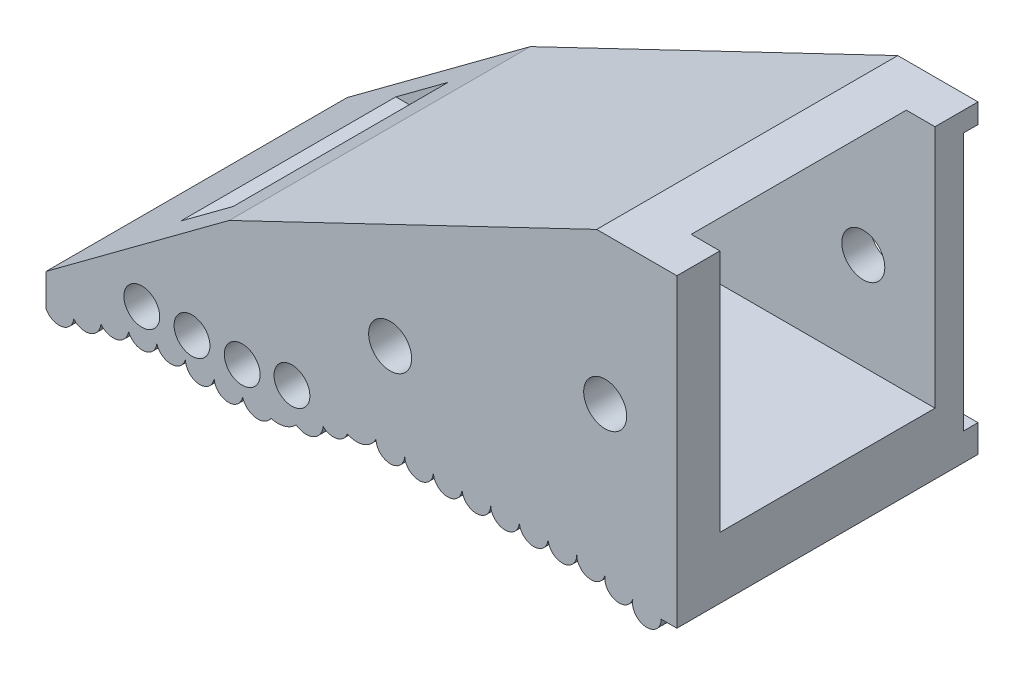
ISO-10303-21;
HEADER;
FILE_DESCRIPTION(('STEP AP214'),'2;1');
FILE_NAME('part.step','',(''),(''),'','','');
FILE_SCHEMA(('AUTOMOTIVE_DESIGN { 1 0 10303 214 1 1 1 1 }'));
ENDSEC;
DATA;
#1=APPLICATION_CONTEXT('core data for automotive mechanical design processes');
#2=APPLICATION_PROTOCOL_DEFINITION('international standard','automotive_design',2000,#1);
#3=PRODUCT_CONTEXT('',#1,'mechanical');
#4=PRODUCT('Part','Part','',(#3));
#5=PRODUCT_RELATED_PRODUCT_CATEGORY('part','',(#4));
#6=PRODUCT_DEFINITION_FORMATION('','',#4);
#7=PRODUCT_DEFINITION_CONTEXT('part definition',#1,'design');
#8=PRODUCT_DEFINITION('design','',#6,#7);
#9=PRODUCT_DEFINITION_SHAPE('','',#8);
#10=(LENGTH_UNIT() NAMED_UNIT(*) SI_UNIT(.MILLI.,.METRE.));
#11=(NAMED_UNIT(*) PLANE_ANGLE_UNIT() SI_UNIT($,.RADIAN.));
#12=(NAMED_UNIT(*) SI_UNIT($,.STERADIAN.) SOLID_ANGLE_UNIT());
#13=UNCERTAINTY_MEASURE_WITH_UNIT(LENGTH_MEASURE(1.E-05),#10,'distance_accuracy_value','');
#14=(GEOMETRIC_REPRESENTATION_CONTEXT(3) GLOBAL_UNCERTAINTY_ASSIGNED_CONTEXT((#13)) GLOBAL_UNIT_ASSIGNED_CONTEXT((#10,
#11,#12)) REPRESENTATION_CONTEXT('',''));
#15=CARTESIAN_POINT('',(0.,0.,0.));
#16=DIRECTION('',(0.,0.,1.));
#17=DIRECTION('',(1.,0.,0.));
#18=AXIS2_PLACEMENT_3D('',#15,#16,#17);
#19=CARTESIAN_POINT('',(-12.7783018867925,7.56792452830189,3.));
#20=DIRECTION('',(1.,0.,0.));
#21=DIRECTION('',(0.,1.,0.));
#22=AXIS2_PLACEMENT_3D('',#19,#20,#21);
#23=PLANE('',#22);
#24=DIRECTION('',(0.,0.,1.));
#25=VECTOR('',#24,1.);
#26=CARTESIAN_POINT('',(-12.7783018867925,-16.4320754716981,-9.));
#27=LINE('',#26,#25);
#28=CARTESIAN_POINT('',(-12.7783018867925,-16.4320754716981,0.));
#29=VERTEX_POINT('',#28);
#30=CARTESIAN_POINT('',(-12.7783018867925,-16.4320754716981,21.));
#31=VERTEX_POINT('',#30);
#32=EDGE_CURVE('E449',#29,#31,#27,.T.);
#33=ORIENTED_EDGE('',*,*,#32,.T.);
#34=DIRECTION('',(0.,-1.,0.));
#35=VECTOR('',#34,1.);
#36=CARTESIAN_POINT('',(-12.7783018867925,7.56792452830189,21.));
#37=LINE('',#36,#35);
#38=CARTESIAN_POINT('',(-12.7783018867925,-14.1707962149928,21.));
#39=VERTEX_POINT('',#38);
#40=EDGE_CURVE('E544',#39,#31,#37,.T.);
#41=ORIENTED_EDGE('',*,*,#40,.F.);
#42=DIRECTION('',(0.,0.,1.));
#43=VECTOR('',#42,1.);
#44=CARTESIAN_POINT('',(-12.7783018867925,-14.1707962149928,-9.));
#45=LINE('',#44,#43);
#46=CARTESIAN_POINT('',(-12.7783018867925,-14.1707962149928,0.));
#47=VERTEX_POINT('',#46);
#48=EDGE_CURVE('E452',#47,#39,#45,.T.);
#49=ORIENTED_EDGE('',*,*,#48,.F.);
#50=DIRECTION('',(0.,-1.,0.));
#51=VECTOR('',#50,1.);
#52=CARTESIAN_POINT('',(-12.7783018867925,7.56792452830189,0.));
#53=LINE('',#52,#51);
#54=EDGE_CURVE('E575',#47,#29,#53,.T.);
#55=ORIENTED_EDGE('',*,*,#54,.T.);
#56=EDGE_LOOP('',(#33,#41,#49,#55));
#57=FACE_BOUND('',#56,.T.);
#58=ADVANCED_FACE('F38',(#57),#23,.F.);
#59=CARTESIAN_POINT('',(31.2216981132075,7.56792452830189,3.));
#60=DIRECTION('',(-1.,0.,0.));
#61=DIRECTION('',(0.,-1.,0.));
#62=AXIS2_PLACEMENT_3D('',#59,#60,#61);
#63=PLANE('',#62);
#64=DIRECTION('',(0.,-1.,0.));
#65=VECTOR('',#64,1.);
#66=CARTESIAN_POINT('',(31.2216981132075,-11.8056304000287,1.));
#67=LINE('',#66,#65);
#68=CARTESIAN_POINT('',(31.2216981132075,6.19436959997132,1.));
#69=VERTEX_POINT('',#68);
#70=CARTESIAN_POINT('',(31.2216981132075,-11.8056304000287,1.));
#71=VERTEX_POINT('',#70);
#72=EDGE_CURVE('E284',#69,#71,#67,.T.);
#73=ORIENTED_EDGE('',*,*,#72,.F.);
#74=DIRECTION('',(0.,0.,-1.));
#75=VECTOR('',#74,1.);
#76=CARTESIAN_POINT('',(31.2216981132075,6.19436959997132,1.));
#77=LINE('',#76,#75);
#78=CARTESIAN_POINT('',(31.2216981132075,6.19436959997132,0.));
#79=VERTEX_POINT('',#78);
#80=EDGE_CURVE('E732',#69,#79,#77,.T.);
#81=ORIENTED_EDGE('',*,*,#80,.T.);
#82=DIRECTION('',(0.,1.,0.));
#83=VECTOR('',#82,1.);
#84=CARTESIAN_POINT('',(31.2216981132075,7.56792452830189,0.));
#85=LINE('',#84,#83);
#86=CARTESIAN_POINT('',(31.2216981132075,7.56792452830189,0.));
#87=VERTEX_POINT('',#86);
#88=EDGE_CURVE('E583',#79,#87,#85,.T.);
#89=ORIENTED_EDGE('',*,*,#88,.T.);
#90=DIRECTION('',(0.,0.,-1.));
#91=VECTOR('',#90,1.);
#92=CARTESIAN_POINT('',(31.2216981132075,7.56792452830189,3.));
#93=LINE('',#92,#91);
#94=CARTESIAN_POINT('',(31.2216981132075,7.56792452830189,3.));
#95=VERTEX_POINT('',#94);
#96=EDGE_CURVE('E12',#95,#87,#93,.T.);
#97=ORIENTED_EDGE('',*,*,#96,.F.);
#98=DIRECTION('',(0.,1.,0.));
#99=VECTOR('',#98,1.);
#100=CARTESIAN_POINT('',(31.2216981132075,7.56792452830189,3.));
#101=LINE('',#100,#99);
#102=CARTESIAN_POINT('',(31.2216981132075,-9.43207547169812,3.));
#103=VERTEX_POINT('',#102);
#104=EDGE_CURVE('E576',#103,#95,#101,.T.);
#105=ORIENTED_EDGE('',*,*,#104,.F.);
#106=DIRECTION('',(0.,0.,-1.));
#107=VECTOR('',#106,1.);
#108=CARTESIAN_POINT('',(31.2216981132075,-9.43207547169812,18.));
#109=LINE('',#108,#107);
#110=CARTESIAN_POINT('',(31.2216981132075,-9.43207547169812,18.));
#111=VERTEX_POINT('',#110);
#112=EDGE_CURVE('E566',#111,#103,#109,.T.);
#113=ORIENTED_EDGE('',*,*,#112,.F.);
#114=DIRECTION('',(0.,1.,0.));
#115=VECTOR('',#114,1.);
#116=CARTESIAN_POINT('',(31.2216981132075,7.56792452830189,18.));
#117=LINE('',#116,#115);
#118=CARTESIAN_POINT('',(31.2216981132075,7.56792452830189,18.));
#119=VERTEX_POINT('',#118);
#120=EDGE_CURVE('E543',#111,#119,#117,.T.);
#121=ORIENTED_EDGE('',*,*,#120,.T.);
#122=DIRECTION('',(0.,0.,-1.));
#123=VECTOR('',#122,1.);
#124=CARTESIAN_POINT('',(31.2216981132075,7.56792452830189,21.));
#125=LINE('',#124,#123);
#126=CARTESIAN_POINT('',(31.2216981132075,7.56792452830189,21.));
#127=VERTEX_POINT('',#126);
#128=EDGE_CURVE('E553',#127,#119,#125,.T.);
#129=ORIENTED_EDGE('',*,*,#128,.F.);
#130=DIRECTION('',(0.,1.,0.));
#131=VECTOR('',#130,1.);
#132=CARTESIAN_POINT('',(31.2216981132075,7.56792452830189,21.));
#133=LINE('',#132,#131);
#134=CARTESIAN_POINT('',(31.2216981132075,-13.7245515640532,21.));
#135=VERTEX_POINT('',#134);
#136=EDGE_CURVE('E547',#135,#127,#133,.T.);
#137=ORIENTED_EDGE('',*,*,#136,.F.);
#138=DIRECTION('',(0.,0.,1.));
#139=VECTOR('',#138,1.);
#140=CARTESIAN_POINT('',(31.2216981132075,-13.7245515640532,-9.));
#141=LINE('',#140,#139);
#142=CARTESIAN_POINT('',(31.2216981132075,-13.7245515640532,0.));
#143=VERTEX_POINT('',#142);
#144=EDGE_CURVE('E460',#143,#135,#141,.T.);
#145=ORIENTED_EDGE('',*,*,#144,.F.);
#146=CARTESIAN_POINT('',(31.2216981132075,-11.8056304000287,0.));
#147=VERTEX_POINT('',#146);
#148=EDGE_CURVE('E300',#143,#147,#85,.T.);
#149=ORIENTED_EDGE('',*,*,#148,.T.);
#150=DIRECTION('',(0.,0.,-1.));
#151=VECTOR('',#150,1.);
#152=CARTESIAN_POINT('',(31.2216981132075,-11.8056304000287,1.));
#153=LINE('',#152,#151);
#154=EDGE_CURVE('E53',#71,#147,#153,.T.);
#155=ORIENTED_EDGE('',*,*,#154,.F.);
#156=EDGE_LOOP('',(#73,#81,#89,#97,#105,#113,#121,#129,#137,#145,#149,#155));
#157=FACE_BOUND('',#156,.T.);
#158=ADVANCED_FACE('F297',(#157),#63,.F.);
#159=CARTESIAN_POINT('',(-12.7783018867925,7.56792452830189,3.));
#160=DIRECTION('',(0.,-1.,0.));
#161=DIRECTION('',(0.,0.,-1.));
#162=AXIS2_PLACEMENT_3D('',#159,#160,#161);
#163=PLANE('',#162);
#164=DIRECTION('',(0.,0.,1.));
#165=VECTOR('',#164,1.);
#166=CARTESIAN_POINT('',(25.6269388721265,7.56792452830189,-9.));
#167=LINE('',#166,#165);
#168=CARTESIAN_POINT('',(25.6269388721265,7.56792452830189,0.));
#169=VERTEX_POINT('',#168);
#170=CARTESIAN_POINT('',(25.6269388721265,7.56792452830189,21.));
#171=VERTEX_POINT('',#170);
#172=EDGE_CURVE('E457',#169,#171,#167,.T.);
#173=ORIENTED_EDGE('',*,*,#172,.T.);
#174=DIRECTION('',(-1.,0.,0.));
#175=VECTOR('',#174,1.);
#176=CARTESIAN_POINT('',(-12.7783018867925,7.56792452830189,21.));
#177=LINE('',#176,#175);
#178=EDGE_CURVE('E550',#127,#171,#177,.T.);
#179=ORIENTED_EDGE('',*,*,#178,.F.);
#180=ORIENTED_EDGE('',*,*,#128,.T.);
#181=DIRECTION('',(-1.,0.,0.));
#182=VECTOR('',#181,1.);
#183=CARTESIAN_POINT('',(-12.7783018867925,7.56792452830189,18.));
#184=LINE('',#183,#182);
#185=CARTESIAN_POINT('',(29.2216981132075,7.56792452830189,18.));
#186=VERTEX_POINT('',#185);
#187=EDGE_CURVE('E548',#119,#186,#184,.T.);
#188=ORIENTED_EDGE('',*,*,#187,.T.);
#189=DIRECTION('',(0.,0.,-1.));
#190=VECTOR('',#189,1.);
#191=CARTESIAN_POINT('',(29.2216981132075,7.56792452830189,18.));
#192=LINE('',#191,#190);
#193=CARTESIAN_POINT('',(29.2216981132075,7.56792452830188,3.));
#194=VERTEX_POINT('',#193);
#195=EDGE_CURVE('E572',#186,#194,#192,.T.);
#196=ORIENTED_EDGE('',*,*,#195,.T.);
#197=DIRECTION('',(-1.,0.,0.));
#198=VECTOR('',#197,1.);
#199=CARTESIAN_POINT('',(-12.7783018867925,7.56792452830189,3.));
#200=LINE('',#199,#198);
#201=EDGE_CURVE('E46',#95,#194,#200,.T.);
#202=ORIENTED_EDGE('',*,*,#201,.F.);
#203=ORIENTED_EDGE('',*,*,#96,.T.);
#204=DIRECTION('',(-1.,0.,0.));
#205=VECTOR('',#204,1.);
#206=CARTESIAN_POINT('',(-12.7783018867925,7.56792452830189,0.));
#207=LINE('',#206,#205);
#208=EDGE_CURVE('E578',#87,#169,#207,.T.);
#209=ORIENTED_EDGE('',*,*,#208,.T.);
#210=EDGE_LOOP('',(#173,#179,#180,#188,#196,#202,#203,#209));
#211=FACE_BOUND('',#210,.T.);
#212=ADVANCED_FACE('F588',(#211),#163,.F.);
#213=CARTESIAN_POINT('',(0.,0.,3.));
#214=DIRECTION('',(0.,0.,1.));
#215=DIRECTION('',(1.,0.,0.));
#216=AXIS2_PLACEMENT_3D('',#213,#214,#215);
#217=PLANE('',#216);
#218=CARTESIAN_POINT('',(11.2216981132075,-6.68207547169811,3.));
#219=DIRECTION('',(0.,0.,1.));
#220=DIRECTION('',(1.,0.,0.));
#221=AXIS2_PLACEMENT_3D('',#218,#219,#220);
#222=CIRCLE('',#221,1.5);
#223=CARTESIAN_POINT('',(12.7216981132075,-6.68207547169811,3.));
#224=VERTEX_POINT('',#223);
#225=EDGE_CURVE('E340',#224,#224,#222,.T.);
#226=ORIENTED_EDGE('',*,*,#225,.F.);
#227=EDGE_LOOP('',(#226));
#228=FACE_BOUND('',#227,.T.);
#229=CARTESIAN_POINT('',(26.2216981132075,-2.68207547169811,3.));
#230=DIRECTION('',(0.,0.,1.));
#231=DIRECTION('',(1.,0.,0.));
#232=AXIS2_PLACEMENT_3D('',#229,#230,#231);
#233=CIRCLE('',#232,1.5);
#234=CARTESIAN_POINT('',(27.7216981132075,-2.68207547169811,3.));
#235=VERTEX_POINT('',#234);
#236=EDGE_CURVE('E349',#235,#235,#233,.T.);
#237=ORIENTED_EDGE('',*,*,#236,.F.);
#238=EDGE_LOOP('',(#237));
#239=FACE_BOUND('',#238,.T.);
#240=DIRECTION('',(0.91281825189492,0.408366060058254,0.));
#241=VECTOR('',#240,1.);
#242=CARTESIAN_POINT('',(29.2216981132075,7.56792452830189,3.));
#243=LINE('',#242,#241);
#244=CARTESIAN_POINT('',(-2.72875212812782,-6.72569794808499,3.));
#245=VERTEX_POINT('',#244);
#246=EDGE_CURVE('E559',#245,#194,#243,.T.);
#247=ORIENTED_EDGE('',*,*,#246,.F.);
#248=DIRECTION('',(-0.803519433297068,-0.595278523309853,0.));
#249=VECTOR('',#248,1.);
#250=CARTESIAN_POINT('',(2.25007035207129,-3.03719214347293,3.));
#251=LINE('',#250,#249);
#252=CARTESIAN_POINT('',(-6.38187726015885,-9.43207547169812,3.));
#253=VERTEX_POINT('',#252);
#254=EDGE_CURVE('E516',#245,#253,#251,.T.);
#255=ORIENTED_EDGE('',*,*,#254,.T.);
#256=DIRECTION('',(-1.,0.,0.));
#257=VECTOR('',#256,1.);
#258=CARTESIAN_POINT('',(-8.77830188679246,-9.43207547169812,3.));
#259=LINE('',#258,#257);
#260=EDGE_CURVE('E563',#103,#253,#259,.T.);
#261=ORIENTED_EDGE('',*,*,#260,.F.);
#262=ORIENTED_EDGE('',*,*,#104,.T.);
#263=ORIENTED_EDGE('',*,*,#201,.T.);
#264=EDGE_LOOP('',(#247,#255,#261,#262,#263));
#265=FACE_BOUND('',#264,.T.);
#266=ADVANCED_FACE('F752',(#228,#239,#265),#217,.T.);
#267=CARTESIAN_POINT('',(0.,0.,0.));
#268=DIRECTION('',(0.,0.,1.));
#269=DIRECTION('',(1.,0.,0.));
#270=AXIS2_PLACEMENT_3D('',#267,#268,#269);
#271=PLANE('',#270);
#272=CARTESIAN_POINT('',(-6.09529267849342,-12.9533373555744,0.));
#273=DIRECTION('',(0.,0.,1.));
#274=DIRECTION('',(1.,0.,0.));
#275=AXIS2_PLACEMENT_3D('',#272,#273,#274);
#276=CIRCLE('',#275,1.25);
#277=CARTESIAN_POINT('',(-4.84529267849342,-12.9533373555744,0.));
#278=VERTEX_POINT('',#277);
#279=EDGE_CURVE('E328',#278,#278,#276,.T.);
#280=ORIENTED_EDGE('',*,*,#279,.T.);
#281=EDGE_LOOP('',(#280));
#282=FACE_BOUND('',#281,.T.);
#283=CARTESIAN_POINT('',(-2.59529267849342,-12.9533373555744,0.));
#284=DIRECTION('',(0.,0.,1.));
#285=DIRECTION('',(1.,0.,0.));
#286=AXIS2_PLACEMENT_3D('',#283,#284,#285);
#287=CIRCLE('',#286,1.25);
#288=CARTESIAN_POINT('',(-1.34529267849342,-12.9533373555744,0.));
#289=VERTEX_POINT('',#288);
#290=EDGE_CURVE('E325',#289,#289,#287,.T.);
#291=ORIENTED_EDGE('',*,*,#290,.T.);
#292=EDGE_LOOP('',(#291));
#293=FACE_BOUND('',#292,.T.);
#294=CARTESIAN_POINT('',(0.904707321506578,-12.9533373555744,0.));
#295=DIRECTION('',(0.,0.,1.));
#296=DIRECTION('',(1.,0.,0.));
#297=AXIS2_PLACEMENT_3D('',#294,#295,#296);
#298=CIRCLE('',#297,1.25);
#299=CARTESIAN_POINT('',(2.15470732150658,-12.9533373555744,0.));
#300=VERTEX_POINT('',#299);
#301=EDGE_CURVE('E322',#300,#300,#298,.T.);
#302=ORIENTED_EDGE('',*,*,#301,.T.);
#303=EDGE_LOOP('',(#302));
#304=FACE_BOUND('',#303,.T.);
#305=CARTESIAN_POINT('',(4.37363290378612,-12.487982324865,0.));
#306=DIRECTION('',(0.,0.,1.));
#307=DIRECTION('',(1.,0.,0.));
#308=AXIS2_PLACEMENT_3D('',#305,#306,#307);
#309=CIRCLE('',#308,1.25);
#310=CARTESIAN_POINT('',(5.62363290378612,-12.487982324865,0.));
#311=VERTEX_POINT('',#310);
#312=EDGE_CURVE('E310',#311,#311,#309,.T.);
#313=ORIENTED_EDGE('',*,*,#312,.T.);
#314=EDGE_LOOP('',(#313));
#315=FACE_BOUND('',#314,.T.);
#316=CARTESIAN_POINT('',(11.2216981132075,-6.68207547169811,0.));
#317=DIRECTION('',(0.,0.,1.));
#318=DIRECTION('',(1.,0.,0.));
#319=AXIS2_PLACEMENT_3D('',#316,#317,#318);
#320=CIRCLE('',#319,1.5);
#321=CARTESIAN_POINT('',(12.7216981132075,-6.68207547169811,0.));
#322=VERTEX_POINT('',#321);
#323=EDGE_CURVE('E337',#322,#322,#320,.T.);
#324=ORIENTED_EDGE('',*,*,#323,.T.);
#325=EDGE_LOOP('',(#324));
#326=FACE_BOUND('',#325,.T.);
#327=ORIENTED_EDGE('',*,*,#88,.F.);
#328=DIRECTION('',(1.,0.,0.));
#329=VECTOR('',#328,1.);
#330=CARTESIAN_POINT('',(31.2216981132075,6.19436959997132,0.));
#331=LINE('',#330,#329);
#332=CARTESIAN_POINT('',(23.2216981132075,6.19436959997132,0.));
#333=VERTEX_POINT('',#332);
#334=EDGE_CURVE('E294',#333,#79,#331,.T.);
#335=ORIENTED_EDGE('',*,*,#334,.F.);
#336=DIRECTION('',(0.,1.,0.));
#337=VECTOR('',#336,1.);
#338=CARTESIAN_POINT('',(23.2216981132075,-11.8056304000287,0.));
#339=LINE('',#338,#337);
#340=CARTESIAN_POINT('',(23.2216981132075,-11.8056304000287,0.));
#341=VERTEX_POINT('',#340);
#342=EDGE_CURVE('E726',#341,#333,#339,.T.);
#343=ORIENTED_EDGE('',*,*,#342,.F.);
#344=DIRECTION('',(-1.,0.,0.));
#345=VECTOR('',#344,1.);
#346=CARTESIAN_POINT('',(31.2216981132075,-11.8056304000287,0.));
#347=LINE('',#346,#345);
#348=EDGE_CURVE('E724',#147,#341,#347,.T.);
#349=ORIENTED_EDGE('',*,*,#348,.F.);
#350=ORIENTED_EDGE('',*,*,#148,.F.);
#351=DIRECTION('',(1.,0.,0.));
#352=VECTOR('',#351,1.);
#353=CARTESIAN_POINT('',(0.,-13.7245515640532,0.));
#354=LINE('',#353,#352);
#355=CARTESIAN_POINT('',(30.1248704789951,-13.7245515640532,0.));
#356=VERTEX_POINT('',#355);
#357=EDGE_CURVE('E507',#356,#143,#354,.T.);
#358=ORIENTED_EDGE('',*,*,#357,.F.);
#359=CARTESIAN_POINT('',(29.124870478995,-13.7245515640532,0.));
#360=DIRECTION('',(0.,0.,1.));
#361=DIRECTION('',(1.,0.,0.));
#362=AXIS2_PLACEMENT_3D('',#359,#360,#361);
#363=CIRCLE('',#362,1.00000000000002);
#364=CARTESIAN_POINT('',(28.1579997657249,-13.4692849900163,0.));
#365=VERTEX_POINT('',#364);
#366=EDGE_CURVE('E505',#365,#356,#363,.T.);
#367=ORIENTED_EDGE('',*,*,#366,.F.);
#368=CARTESIAN_POINT('',(27.1911290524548,-13.2140184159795,0.));
#369=DIRECTION('',(0.,0.,1.));
#370=DIRECTION('',(1.,0.,0.));
#371=AXIS2_PLACEMENT_3D('',#368,#369,#370);
#372=CIRCLE('',#371,0.99999999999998);
#373=CARTESIAN_POINT('',(26.2143065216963,-12.9999676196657,0.));
#374=VERTEX_POINT('',#373);
#375=EDGE_CURVE('E503',#374,#365,#372,.T.);
#376=ORIENTED_EDGE('',*,*,#375,.F.);
#377=CARTESIAN_POINT('',(25.2374839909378,-12.7859168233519,0.));
#378=DIRECTION('',(0.,0.,1.));
#379=DIRECTION('',(1.,0.,0.));
#380=AXIS2_PLACEMENT_3D('',#377,#378,#379);
#381=CIRCLE('',#380,1.00000000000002);
#382=CARTESIAN_POINT('',(24.2374839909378,-12.7859168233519,0.));
#383=VERTEX_POINT('',#382);
#384=EDGE_CURVE('E501',#383,#374,#381,.T.);
#385=ORIENTED_EDGE('',*,*,#384,.F.);
#386=CARTESIAN_POINT('',(23.2374839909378,-12.7859168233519,0.));
#387=DIRECTION('',(0.,0.,1.));
#388=DIRECTION('',(1.,0.,0.));
#389=AXIS2_PLACEMENT_3D('',#386,#387,#388);
#390=CIRCLE('',#389,0.999999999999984);
#391=CARTESIAN_POINT('',(22.2374839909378,-12.7859168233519,0.));
#392=VERTEX_POINT('',#391);
#393=EDGE_CURVE('E499',#392,#383,#390,.T.);
#394=ORIENTED_EDGE('',*,*,#393,.F.);
#395=CARTESIAN_POINT('',(21.2374839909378,-12.7859168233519,0.));
#396=DIRECTION('',(0.,0.,1.));
#397=DIRECTION('',(1.,0.,0.));
#398=AXIS2_PLACEMENT_3D('',#395,#396,#397);
#399=CIRCLE('',#398,1.00000000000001);
#400=CARTESIAN_POINT('',(20.2374839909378,-12.7859168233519,0.));
#401=VERTEX_POINT('',#400);
#402=EDGE_CURVE('E497',#401,#392,#399,.T.);
#403=ORIENTED_EDGE('',*,*,#402,.F.);
#404=CARTESIAN_POINT('',(19.2374839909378,-12.7859168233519,0.));
#405=DIRECTION('',(0.,0.,1.));
#406=DIRECTION('',(1.,0.,0.));
#407=AXIS2_PLACEMENT_3D('',#404,#405,#406);
#408=CIRCLE('',#407,0.999999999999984);
#409=CARTESIAN_POINT('',(18.2374839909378,-12.7859168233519,0.));
#410=VERTEX_POINT('',#409);
#411=EDGE_CURVE('E495',#410,#401,#408,.T.);
#412=ORIENTED_EDGE('',*,*,#411,.F.);
#413=CARTESIAN_POINT('',(17.2374839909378,-12.7859168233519,0.));
#414=DIRECTION('',(0.,0.,1.));
#415=DIRECTION('',(1.,0.,0.));
#416=AXIS2_PLACEMENT_3D('',#413,#414,#415);
#417=CIRCLE('',#416,1.00000000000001);
#418=CARTESIAN_POINT('',(16.2374839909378,-12.7859168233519,0.));
#419=VERTEX_POINT('',#418);
#420=EDGE_CURVE('E493',#419,#410,#417,.T.);
#421=ORIENTED_EDGE('',*,*,#420,.F.);
#422=CARTESIAN_POINT('',(15.2374839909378,-12.7859168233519,0.));
#423=DIRECTION('',(0.,0.,1.));
#424=DIRECTION('',(1.,0.,0.));
#425=AXIS2_PLACEMENT_3D('',#422,#423,#424);
#426=CIRCLE('',#425,0.999999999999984);
#427=CARTESIAN_POINT('',(14.2374839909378,-12.7859168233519,0.));
#428=VERTEX_POINT('',#427);
#429=EDGE_CURVE('E491',#428,#419,#426,.T.);
#430=ORIENTED_EDGE('',*,*,#429,.F.);
#431=CARTESIAN_POINT('',(13.2374839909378,-12.7859168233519,0.));
#432=DIRECTION('',(0.,0.,1.));
#433=DIRECTION('',(1.,0.,0.));
#434=AXIS2_PLACEMENT_3D('',#431,#432,#433);
#435=CIRCLE('',#434,1.00000000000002);
#436=CARTESIAN_POINT('',(12.2374839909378,-12.7859168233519,0.));
#437=VERTEX_POINT('',#436);
#438=EDGE_CURVE('E489',#437,#428,#435,.T.);
#439=ORIENTED_EDGE('',*,*,#438,.F.);
#440=CARTESIAN_POINT('',(11.2374839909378,-12.7859168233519,0.));
#441=DIRECTION('',(0.,0.,1.));
#442=DIRECTION('',(1.,0.,0.));
#443=AXIS2_PLACEMENT_3D('',#440,#441,#442);
#444=CIRCLE('',#443,0.999999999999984);
#445=CARTESIAN_POINT('',(10.2374839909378,-12.7859168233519,0.));
#446=VERTEX_POINT('',#445);
#447=EDGE_CURVE('E487',#446,#437,#444,.T.);
#448=ORIENTED_EDGE('',*,*,#447,.F.);
#449=CARTESIAN_POINT('',(8.89247256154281,-12.131448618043,0.));
#450=DIRECTION('',(0.,0.,1.));
#451=DIRECTION('',(1.,0.,0.));
#452=AXIS2_PLACEMENT_3D('',#449,#450,#451);
#453=CIRCLE('',#452,1.49578888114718);
#454=CARTESIAN_POINT('',(8.23800435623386,-13.476460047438,0.));
#455=VERTEX_POINT('',#454);
#456=EDGE_CURVE('E430',#455,#446,#453,.T.);
#457=ORIENTED_EDGE('',*,*,#456,.F.);
#458=CARTESIAN_POINT('',(7.26475376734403,-13.1150603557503,0.));
#459=DIRECTION('',(0.,0.,1.));
#460=DIRECTION('',(1.,0.,0.));
#461=AXIS2_PLACEMENT_3D('',#458,#459,#460);
#462=CIRCLE('',#461,1.03818420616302);
#463=CARTESIAN_POINT('',(6.55334804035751,-13.8711875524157,0.));
#464=VERTEX_POINT('',#463);
#465=EDGE_CURVE('E541',#464,#455,#462,.T.);
#466=ORIENTED_EDGE('',*,*,#465,.F.);
#467=CARTESIAN_POINT('',(5.3699333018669,-13.7551036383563,0.));
#468=DIRECTION('',(0.,0.,1.));
#469=DIRECTION('',(1.,0.,0.));
#470=AXIS2_PLACEMENT_3D('',#467,#468,#469);
#471=CIRCLE('',#470,1.18909457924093);
#472=CARTESIAN_POINT('',(4.67424723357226,-14.7194515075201,0.));
#473=VERTEX_POINT('',#472);
#474=EDGE_CURVE('E539',#473,#464,#471,.T.);
#475=ORIENTED_EDGE('',*,*,#474,.F.);
#476=CARTESIAN_POINT('',(3.38888148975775,-13.4804516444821,0.));
#477=DIRECTION('',(0.,0.,1.));
#478=DIRECTION('',(1.,0.,0.));
#479=AXIS2_PLACEMENT_3D('',#476,#477,#478);
#480=CIRCLE('',#479,1.78529710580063);
#481=CARTESIAN_POINT('',(2.91014395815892,-15.2003633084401,0.));
#482=VERTEX_POINT('',#481);
#483=EDGE_CURVE('E537',#482,#473,#480,.T.);
#484=ORIENTED_EDGE('',*,*,#483,.F.);
#485=CARTESIAN_POINT('',(1.98983234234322,-14.6151646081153,0.));
#486=DIRECTION('',(0.,0.,1.));
#487=DIRECTION('',(1.,0.,0.));
#488=AXIS2_PLACEMENT_3D('',#485,#486,#487);
#489=CIRCLE('',#488,1.09061037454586);
#490=CARTESIAN_POINT('',(0.934546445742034,-14.8904874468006,0.));
#491=VERTEX_POINT('',#490);
#492=EDGE_CURVE('E535',#491,#482,#489,.T.);
#493=ORIENTED_EDGE('',*,*,#492,.F.);
#494=CARTESIAN_POINT('',(-0.050812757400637,-14.719996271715,0.));
#495=DIRECTION('',(0.,0.,1.));
#496=DIRECTION('',(1.,0.,0.));
#497=AXIS2_PLACEMENT_3D('',#494,#495,#496);
#498=CIRCLE('',#497,1.);
#499=CARTESIAN_POINT('',(-1.05013096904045,-14.6830759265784,0.));
#500=VERTEX_POINT('',#499);
#501=EDGE_CURVE('E533',#500,#491,#498,.T.);
#502=ORIENTED_EDGE('',*,*,#501,.F.);
#503=CARTESIAN_POINT('',(-2.04941287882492,-14.6461569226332,0.));
#504=DIRECTION('',(0.,0.,1.));
#505=DIRECTION('',(1.,0.,0.));
#506=AXIS2_PLACEMENT_3D('',#503,#504,#505);
#507=CIRCLE('',#506,0.999963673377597);
#508=CARTESIAN_POINT('',(-3.04884305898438,-14.6134971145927,0.));
#509=VERTEX_POINT('',#508);
#510=EDGE_CURVE('E531',#509,#500,#507,.T.);
#511=ORIENTED_EDGE('',*,*,#510,.F.);
#512=CARTESIAN_POINT('',(-4.05600076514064,-14.3756676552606,0.));
#513=DIRECTION('',(0.,0.,1.));
#514=DIRECTION('',(1.,0.,0.));
#515=AXIS2_PLACEMENT_3D('',#512,#513,#514);
#516=CIRCLE('',#515,1.03485723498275);
#517=CARTESIAN_POINT('',(-5.04913448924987,-14.6665540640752,0.));
#518=VERTEX_POINT('',#517);
#519=EDGE_CURVE('E529',#518,#509,#516,.T.);
#520=ORIENTED_EDGE('',*,*,#519,.F.);
#521=CARTESIAN_POINT('',(-6.06388338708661,-14.553216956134,0.));
#522=DIRECTION('',(0.,0.,1.));
#523=DIRECTION('',(1.,0.,0.));
#524=AXIS2_PLACEMENT_3D('',#521,#522,#523);
#525=CIRCLE('',#524,1.02105858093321);
#526=CARTESIAN_POINT('',(-7.01772115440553,-14.9175713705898,0.));
#527=VERTEX_POINT('',#526);
#528=EDGE_CURVE('E527',#527,#518,#525,.T.);
#529=ORIENTED_EDGE('',*,*,#528,.F.);
#530=CARTESIAN_POINT('',(-8.09375318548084,-14.7614181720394,0.));
#531=DIRECTION('',(0.,0.,1.));
#532=DIRECTION('',(1.,0.,0.));
#533=AXIS2_PLACEMENT_3D('',#530,#531,#532);
#534=CIRCLE('',#533,1.08730343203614);
#535=CARTESIAN_POINT('',(-8.95158467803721,-15.4295153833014,0.));
#536=VERTEX_POINT('',#535);
#537=EDGE_CURVE('E525',#536,#527,#534,.T.);
#538=ORIENTED_EDGE('',*,*,#537,.F.);
#539=CARTESIAN_POINT('',(-10.0391082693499,-15.3435044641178,0.));
#540=DIRECTION('',(0.,0.,1.));
#541=DIRECTION('',(1.,0.,0.));
#542=AXIS2_PLACEMENT_3D('',#539,#540,#541);
#543=CIRCLE('',#542,1.09091953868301);
#544=CARTESIAN_POINT('',(-10.8412542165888,-16.0828740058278,0.));
#545=VERTEX_POINT('',#544);
#546=EDGE_CURVE('E523',#545,#536,#543,.T.);
#547=ORIENTED_EDGE('',*,*,#546,.F.);
#548=CARTESIAN_POINT('',(-11.8679082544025,-15.9350219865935,0.));
#549=DIRECTION('',(0.,0.,1.));
#550=DIRECTION('',(1.,0.,0.));
#551=AXIS2_PLACEMENT_3D('',#548,#549,#550);
#552=CIRCLE('',#551,1.03724574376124);
#553=EDGE_CURVE('E521',#29,#545,#552,.T.);
#554=ORIENTED_EDGE('',*,*,#553,.F.);
#555=ORIENTED_EDGE('',*,*,#54,.F.);
#556=DIRECTION('',(-0.803519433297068,-0.595278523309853,0.));
#557=VECTOR('',#556,1.);
#558=CARTESIAN_POINT('',(2.25007035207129,-3.03719214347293,0.));
#559=LINE('',#558,#557);
#560=CARTESIAN_POINT('',(0.,-4.70413198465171,0.));
#561=VERTEX_POINT('',#560);
#562=EDGE_CURVE('E519',#561,#47,#559,.T.);
#563=ORIENTED_EDGE('',*,*,#562,.F.);
#564=DIRECTION('',(-0.901919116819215,-0.431904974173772,0.));
#565=VECTOR('',#564,1.);
#566=CARTESIAN_POINT('',(1.83246334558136,-3.82661423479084,0.));
#567=LINE('',#566,#565);
#568=EDGE_CURVE('E509',#169,#561,#567,.T.);
#569=ORIENTED_EDGE('',*,*,#568,.F.);
#570=ORIENTED_EDGE('',*,*,#208,.F.);
#571=EDGE_LOOP('',(#327,#335,#343,#349,#350,#358,#367,#376,#385,#394,#403,#412,#421,#430,#439,
#448,#457,#466,#475,#484,#493,#502,#511,#520,#529,#538,#547,#554,#555,#563,#569,#570));
#572=FACE_BOUND('',#571,.T.);
#573=ADVANCED_FACE('F595',(#282,#293,#304,#315,#326,#572),#271,.F.);
#574=CARTESIAN_POINT('',(29.2216981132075,7.56792452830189,18.));
#575=DIRECTION('',(-0.408366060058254,0.91281825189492,0.));
#576=DIRECTION('',(-0.91281825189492,-0.408366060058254,0.));
#577=AXIS2_PLACEMENT_3D('',#574,#575,#576);
#578=PLANE('',#577);
#579=DIRECTION('',(0.,0.,1.));
#580=VECTOR('',#579,1.);
#581=CARTESIAN_POINT('',(-2.72875212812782,-6.72569794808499,18.));
#582=LINE('',#581,#580);
#583=CARTESIAN_POINT('',(-2.7287521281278,-6.72569794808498,18.));
#584=VERTEX_POINT('',#583);
#585=EDGE_CURVE('E61',#245,#584,#582,.T.);
#586=ORIENTED_EDGE('',*,*,#585,.F.);
#587=ORIENTED_EDGE('',*,*,#246,.T.);
#588=ORIENTED_EDGE('',*,*,#195,.F.);
#589=DIRECTION('',(0.91281825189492,0.408366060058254,0.));
#590=VECTOR('',#589,1.);
#591=CARTESIAN_POINT('',(29.2216981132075,7.56792452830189,18.));
#592=LINE('',#591,#590);
#593=EDGE_CURVE('E560',#584,#186,#592,.T.);
#594=ORIENTED_EDGE('',*,*,#593,.F.);
#595=EDGE_LOOP('',(#586,#587,#588,#594));
#596=FACE_BOUND('',#595,.T.);
#597=ADVANCED_FACE('F757',(#596),#578,.F.);
#598=CARTESIAN_POINT('',(-8.77830188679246,-9.43207547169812,18.));
#599=DIRECTION('',(0.,-1.,0.));
#600=DIRECTION('',(0.,0.,-1.));
#601=AXIS2_PLACEMENT_3D('',#598,#599,#600);
#602=PLANE('',#601);
#603=DIRECTION('',(0.,0.,-1.));
#604=VECTOR('',#603,1.);
#605=CARTESIAN_POINT('',(-6.38187726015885,-9.43207547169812,18.));
#606=LINE('',#605,#604);
#607=CARTESIAN_POINT('',(-6.38187726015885,-9.43207547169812,18.));
#608=VERTEX_POINT('',#607);
#609=EDGE_CURVE('E513',#608,#253,#606,.T.);
#610=ORIENTED_EDGE('',*,*,#609,.F.);
#611=DIRECTION('',(-1.,0.,0.));
#612=VECTOR('',#611,1.);
#613=CARTESIAN_POINT('',(-8.77830188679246,-9.43207547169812,18.));
#614=LINE('',#613,#612);
#615=EDGE_CURVE('E562',#111,#608,#614,.T.);
#616=ORIENTED_EDGE('',*,*,#615,.F.);
#617=ORIENTED_EDGE('',*,*,#112,.T.);
#618=ORIENTED_EDGE('',*,*,#260,.T.);
#619=EDGE_LOOP('',(#610,#616,#617,#618));
#620=FACE_BOUND('',#619,.T.);
#621=ADVANCED_FACE('F764',(#620),#602,.F.);
#622=CARTESIAN_POINT('',(0.,0.,18.));
#623=DIRECTION('',(0.,0.,1.));
#624=DIRECTION('',(1.,0.,0.));
#625=AXIS2_PLACEMENT_3D('',#622,#623,#624);
#626=PLANE('',#625);
#627=CARTESIAN_POINT('',(11.2216981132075,-6.68207547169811,18.));
#628=DIRECTION('',(0.,0.,1.));
#629=DIRECTION('',(1.,0.,0.));
#630=AXIS2_PLACEMENT_3D('',#627,#628,#629);
#631=CIRCLE('',#630,1.5);
#632=CARTESIAN_POINT('',(12.7216981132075,-6.68207547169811,18.));
#633=VERTEX_POINT('',#632);
#634=EDGE_CURVE('E334',#633,#633,#631,.T.);
#635=ORIENTED_EDGE('',*,*,#634,.T.);
#636=EDGE_LOOP('',(#635));
#637=FACE_BOUND('',#636,.T.);
#638=CARTESIAN_POINT('',(26.2216981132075,-2.68207547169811,18.));
#639=DIRECTION('',(0.,0.,1.));
#640=DIRECTION('',(1.,0.,0.));
#641=AXIS2_PLACEMENT_3D('',#638,#639,#640);
#642=CIRCLE('',#641,1.5);
#643=CARTESIAN_POINT('',(27.7216981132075,-2.68207547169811,18.));
#644=VERTEX_POINT('',#643);
#645=EDGE_CURVE('E346',#644,#644,#642,.T.);
#646=ORIENTED_EDGE('',*,*,#645,.T.);
#647=EDGE_LOOP('',(#646));
#648=FACE_BOUND('',#647,.T.);
#649=DIRECTION('',(-0.803519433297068,-0.595278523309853,0.));
#650=VECTOR('',#649,1.);
#651=CARTESIAN_POINT('',(2.25007035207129,-3.03719214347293,18.));
#652=LINE('',#651,#650);
#653=EDGE_CURVE('E511',#584,#608,#652,.T.);
#654=ORIENTED_EDGE('',*,*,#653,.F.);
#655=ORIENTED_EDGE('',*,*,#593,.T.);
#656=ORIENTED_EDGE('',*,*,#187,.F.);
#657=ORIENTED_EDGE('',*,*,#120,.F.);
#658=ORIENTED_EDGE('',*,*,#615,.T.);
#659=EDGE_LOOP('',(#654,#655,#656,#657,#658));
#660=FACE_BOUND('',#659,.T.);
#661=ADVANCED_FACE('F768',(#637,#648,#660),#626,.F.);
#662=CARTESIAN_POINT('',(0.,0.,21.));
#663=DIRECTION('',(0.,0.,1.));
#664=DIRECTION('',(1.,0.,0.));
#665=AXIS2_PLACEMENT_3D('',#662,#663,#664);
#666=PLANE('',#665);
#667=CARTESIAN_POINT('',(-6.09529267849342,-12.9533373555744,21.));
#668=DIRECTION('',(0.,0.,1.));
#669=DIRECTION('',(1.,0.,0.));
#670=AXIS2_PLACEMENT_3D('',#667,#668,#669);
#671=CIRCLE('',#670,1.25);
#672=CARTESIAN_POINT('',(-4.84529267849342,-12.9533373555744,21.));
#673=VERTEX_POINT('',#672);
#674=EDGE_CURVE('E307',#673,#673,#671,.T.);
#675=ORIENTED_EDGE('',*,*,#674,.F.);
#676=EDGE_LOOP('',(#675));
#677=FACE_BOUND('',#676,.T.);
#678=CARTESIAN_POINT('',(-2.59529267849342,-12.9533373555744,21.));
#679=DIRECTION('',(0.,0.,1.));
#680=DIRECTION('',(1.,0.,0.));
#681=AXIS2_PLACEMENT_3D('',#678,#679,#680);
#682=CIRCLE('',#681,1.25);
#683=CARTESIAN_POINT('',(-1.34529267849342,-12.9533373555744,21.));
#684=VERTEX_POINT('',#683);
#685=EDGE_CURVE('E311',#684,#684,#682,.T.);
#686=ORIENTED_EDGE('',*,*,#685,.F.);
#687=EDGE_LOOP('',(#686));
#688=FACE_BOUND('',#687,.T.);
#689=CARTESIAN_POINT('',(0.904707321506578,-12.9533373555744,21.));
#690=DIRECTION('',(0.,0.,1.));
#691=DIRECTION('',(1.,0.,0.));
#692=AXIS2_PLACEMENT_3D('',#689,#690,#691);
#693=CIRCLE('',#692,1.25);
#694=CARTESIAN_POINT('',(2.15470732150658,-12.9533373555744,21.));
#695=VERTEX_POINT('',#694);
#696=EDGE_CURVE('E314',#695,#695,#693,.T.);
#697=ORIENTED_EDGE('',*,*,#696,.F.);
#698=EDGE_LOOP('',(#697));
#699=FACE_BOUND('',#698,.T.);
#700=CARTESIAN_POINT('',(4.37363290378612,-12.487982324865,21.));
#701=DIRECTION('',(0.,0.,1.));
#702=DIRECTION('',(1.,0.,0.));
#703=AXIS2_PLACEMENT_3D('',#700,#701,#702);
#704=CIRCLE('',#703,1.25);
#705=CARTESIAN_POINT('',(5.62363290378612,-12.487982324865,21.));
#706=VERTEX_POINT('',#705);
#707=EDGE_CURVE('E317',#706,#706,#704,.T.);
#708=ORIENTED_EDGE('',*,*,#707,.F.);
#709=EDGE_LOOP('',(#708));
#710=FACE_BOUND('',#709,.T.);
#711=CARTESIAN_POINT('',(11.2216981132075,-6.68207547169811,21.));
#712=DIRECTION('',(0.,0.,1.));
#713=DIRECTION('',(1.,0.,0.));
#714=AXIS2_PLACEMENT_3D('',#711,#712,#713);
#715=CIRCLE('',#714,1.5);
#716=CARTESIAN_POINT('',(12.7216981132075,-6.68207547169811,21.));
#717=VERTEX_POINT('',#716);
#718=EDGE_CURVE('E331',#717,#717,#715,.T.);
#719=ORIENTED_EDGE('',*,*,#718,.F.);
#720=EDGE_LOOP('',(#719));
#721=FACE_BOUND('',#720,.T.);
#722=CARTESIAN_POINT('',(26.2216981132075,-2.68207547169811,21.));
#723=DIRECTION('',(0.,0.,1.));
#724=DIRECTION('',(1.,0.,0.));
#725=AXIS2_PLACEMENT_3D('',#722,#723,#724);
#726=CIRCLE('',#725,1.5);
#727=CARTESIAN_POINT('',(27.7216981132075,-2.68207547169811,21.));
#728=VERTEX_POINT('',#727);
#729=EDGE_CURVE('E343',#728,#728,#726,.T.);
#730=ORIENTED_EDGE('',*,*,#729,.F.);
#731=EDGE_LOOP('',(#730));
#732=FACE_BOUND('',#731,.T.);
#733=DIRECTION('',(-0.901919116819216,-0.431904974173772,0.));
#734=VECTOR('',#733,1.);
#735=CARTESIAN_POINT('',(25.6269388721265,7.56792452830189,21.));
#736=LINE('',#735,#734);
#737=CARTESIAN_POINT('',(0.,-4.70413198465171,21.));
#738=VERTEX_POINT('',#737);
#739=EDGE_CURVE('E391',#171,#738,#736,.T.);
#740=ORIENTED_EDGE('',*,*,#739,.T.);
#741=DIRECTION('',(-0.803519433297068,-0.595278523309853,0.));
#742=VECTOR('',#741,1.);
#743=CARTESIAN_POINT('',(0.,-4.70413198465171,21.));
#744=LINE('',#743,#742);
#745=EDGE_CURVE('E394',#738,#39,#744,.T.);
#746=ORIENTED_EDGE('',*,*,#745,.T.);
#747=ORIENTED_EDGE('',*,*,#40,.T.);
#748=CARTESIAN_POINT('',(-11.8679082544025,-15.9350219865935,21.));
#749=DIRECTION('',(0.,0.,1.));
#750=DIRECTION('',(1.,0.,0.));
#751=AXIS2_PLACEMENT_3D('',#748,#749,#750);
#752=CIRCLE('',#751,1.03724574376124);
#753=CARTESIAN_POINT('',(-10.8412542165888,-16.0828740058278,21.));
#754=VERTEX_POINT('',#753);
#755=EDGE_CURVE('E397',#31,#754,#752,.T.);
#756=ORIENTED_EDGE('',*,*,#755,.T.);
#757=CARTESIAN_POINT('',(-10.0391082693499,-15.3435044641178,21.));
#758=DIRECTION('',(0.,0.,1.));
#759=DIRECTION('',(1.,0.,0.));
#760=AXIS2_PLACEMENT_3D('',#757,#758,#759);
#761=CIRCLE('',#760,1.09091953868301);
#762=CARTESIAN_POINT('',(-8.95158467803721,-15.4295153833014,21.));
#763=VERTEX_POINT('',#762);
#764=EDGE_CURVE('E400',#754,#763,#761,.T.);
#765=ORIENTED_EDGE('',*,*,#764,.T.);
#766=CARTESIAN_POINT('',(-8.09375318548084,-14.7614181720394,21.));
#767=DIRECTION('',(0.,0.,1.));
#768=DIRECTION('',(1.,0.,0.));
#769=AXIS2_PLACEMENT_3D('',#766,#767,#768);
#770=CIRCLE('',#769,1.08730343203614);
#771=CARTESIAN_POINT('',(-7.01772115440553,-14.9175713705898,21.));
#772=VERTEX_POINT('',#771);
#773=EDGE_CURVE('E403',#763,#772,#770,.T.);
#774=ORIENTED_EDGE('',*,*,#773,.T.);
#775=CARTESIAN_POINT('',(-6.06388338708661,-14.553216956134,21.));
#776=DIRECTION('',(0.,0.,1.));
#777=DIRECTION('',(-1.,0.,0.));
#778=AXIS2_PLACEMENT_3D('',#775,#776,#777);
#779=CIRCLE('',#778,1.02105858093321);
#780=CARTESIAN_POINT('',(-5.04913448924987,-14.6665540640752,21.));
#781=VERTEX_POINT('',#780);
#782=EDGE_CURVE('E406',#772,#781,#779,.T.);
#783=ORIENTED_EDGE('',*,*,#782,.T.);
#784=CARTESIAN_POINT('',(-4.05600076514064,-14.3756676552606,21.));
#785=DIRECTION('',(0.,0.,1.));
#786=DIRECTION('',(1.,0.,0.));
#787=AXIS2_PLACEMENT_3D('',#784,#785,#786);
#788=CIRCLE('',#787,1.03485723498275);
#789=CARTESIAN_POINT('',(-3.04884305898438,-14.6134971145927,21.));
#790=VERTEX_POINT('',#789);
#791=EDGE_CURVE('E409',#781,#790,#788,.T.);
#792=ORIENTED_EDGE('',*,*,#791,.T.);
#793=CARTESIAN_POINT('',(-2.04941287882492,-14.6461569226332,21.));
#794=DIRECTION('',(0.,0.,1.));
#795=DIRECTION('',(1.,0.,0.));
#796=AXIS2_PLACEMENT_3D('',#793,#794,#795);
#797=CIRCLE('',#796,0.999963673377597);
#798=CARTESIAN_POINT('',(-1.05013096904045,-14.6830759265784,21.));
#799=VERTEX_POINT('',#798);
#800=EDGE_CURVE('E412',#790,#799,#797,.T.);
#801=ORIENTED_EDGE('',*,*,#800,.T.);
#802=CARTESIAN_POINT('',(-0.050812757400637,-14.719996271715,21.));
#803=DIRECTION('',(0.,0.,1.));
#804=DIRECTION('',(1.,0.,0.));
#805=AXIS2_PLACEMENT_3D('',#802,#803,#804);
#806=CIRCLE('',#805,1.);
#807=CARTESIAN_POINT('',(0.934546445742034,-14.8904874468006,21.));
#808=VERTEX_POINT('',#807);
#809=EDGE_CURVE('E415',#799,#808,#806,.T.);
#810=ORIENTED_EDGE('',*,*,#809,.T.);
#811=CARTESIAN_POINT('',(1.98983234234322,-14.6151646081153,21.));
#812=DIRECTION('',(0.,0.,1.));
#813=DIRECTION('',(1.,0.,0.));
#814=AXIS2_PLACEMENT_3D('',#811,#812,#813);
#815=CIRCLE('',#814,1.09061037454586);
#816=CARTESIAN_POINT('',(2.91014395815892,-15.2003633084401,21.));
#817=VERTEX_POINT('',#816);
#818=EDGE_CURVE('E418',#808,#817,#815,.T.);
#819=ORIENTED_EDGE('',*,*,#818,.T.);
#820=CARTESIAN_POINT('',(3.38888148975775,-13.4804516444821,21.));
#821=DIRECTION('',(0.,0.,1.));
#822=DIRECTION('',(1.,0.,0.));
#823=AXIS2_PLACEMENT_3D('',#820,#821,#822);
#824=CIRCLE('',#823,1.78529710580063);
#825=CARTESIAN_POINT('',(4.67424723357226,-14.7194515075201,21.));
#826=VERTEX_POINT('',#825);
#827=EDGE_CURVE('E421',#817,#826,#824,.T.);
#828=ORIENTED_EDGE('',*,*,#827,.T.);
#829=CARTESIAN_POINT('',(5.3699333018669,-13.7551036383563,21.));
#830=DIRECTION('',(0.,0.,1.));
#831=DIRECTION('',(1.,0.,0.));
#832=AXIS2_PLACEMENT_3D('',#829,#830,#831);
#833=CIRCLE('',#832,1.18909457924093);
#834=CARTESIAN_POINT('',(6.55334804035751,-13.8711875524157,21.));
#835=VERTEX_POINT('',#834);
#836=EDGE_CURVE('E424',#826,#835,#833,.T.);
#837=ORIENTED_EDGE('',*,*,#836,.T.);
#838=CARTESIAN_POINT('',(7.26475376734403,-13.1150603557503,21.));
#839=DIRECTION('',(0.,0.,1.));
#840=DIRECTION('',(1.,0.,0.));
#841=AXIS2_PLACEMENT_3D('',#838,#839,#840);
#842=CIRCLE('',#841,1.03818420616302);
#843=CARTESIAN_POINT('',(8.23800435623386,-13.476460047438,21.));
#844=VERTEX_POINT('',#843);
#845=EDGE_CURVE('E352',#835,#844,#842,.T.);
#846=ORIENTED_EDGE('',*,*,#845,.T.);
#847=CARTESIAN_POINT('',(8.89247256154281,-12.131448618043,21.));
#848=DIRECTION('',(0.,0.,1.));
#849=DIRECTION('',(-1.,0.,0.));
#850=AXIS2_PLACEMENT_3D('',#847,#848,#849);
#851=CIRCLE('',#850,1.49578888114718);
#852=CARTESIAN_POINT('',(10.2374839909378,-12.7859168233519,21.));
#853=VERTEX_POINT('',#852);
#854=EDGE_CURVE('E355',#844,#853,#851,.T.);
#855=ORIENTED_EDGE('',*,*,#854,.T.);
#856=CARTESIAN_POINT('',(11.2374839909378,-12.7859168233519,21.));
#857=DIRECTION('',(0.,0.,1.));
#858=DIRECTION('',(1.,0.,0.));
#859=AXIS2_PLACEMENT_3D('',#856,#857,#858);
#860=CIRCLE('',#859,0.999999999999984);
#861=CARTESIAN_POINT('',(12.2374839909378,-12.7859168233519,21.));
#862=VERTEX_POINT('',#861);
#863=EDGE_CURVE('E358',#853,#862,#860,.T.);
#864=ORIENTED_EDGE('',*,*,#863,.T.);
#865=CARTESIAN_POINT('',(13.2374839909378,-12.7859168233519,21.));
#866=DIRECTION('',(0.,0.,1.));
#867=DIRECTION('',(1.,0.,0.));
#868=AXIS2_PLACEMENT_3D('',#865,#866,#867);
#869=CIRCLE('',#868,1.00000000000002);
#870=CARTESIAN_POINT('',(14.2374839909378,-12.7859168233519,21.));
#871=VERTEX_POINT('',#870);
#872=EDGE_CURVE('E361',#862,#871,#869,.T.);
#873=ORIENTED_EDGE('',*,*,#872,.T.);
#874=CARTESIAN_POINT('',(15.2374839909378,-12.7859168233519,21.));
#875=DIRECTION('',(0.,0.,1.));
#876=DIRECTION('',(1.,0.,0.));
#877=AXIS2_PLACEMENT_3D('',#874,#875,#876);
#878=CIRCLE('',#877,0.999999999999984);
#879=CARTESIAN_POINT('',(16.2374839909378,-12.7859168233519,21.));
#880=VERTEX_POINT('',#879);
#881=EDGE_CURVE('E364',#871,#880,#878,.T.);
#882=ORIENTED_EDGE('',*,*,#881,.T.);
#883=CARTESIAN_POINT('',(17.2374839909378,-12.7859168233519,21.));
#884=DIRECTION('',(0.,0.,1.));
#885=DIRECTION('',(1.,0.,0.));
#886=AXIS2_PLACEMENT_3D('',#883,#884,#885);
#887=CIRCLE('',#886,1.00000000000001);
#888=CARTESIAN_POINT('',(18.2374839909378,-12.7859168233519,21.));
#889=VERTEX_POINT('',#888);
#890=EDGE_CURVE('E367',#880,#889,#887,.T.);
#891=ORIENTED_EDGE('',*,*,#890,.T.);
#892=CARTESIAN_POINT('',(19.2374839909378,-12.7859168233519,21.));
#893=DIRECTION('',(0.,0.,1.));
#894=DIRECTION('',(1.,0.,0.));
#895=AXIS2_PLACEMENT_3D('',#892,#893,#894);
#896=CIRCLE('',#895,0.999999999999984);
#897=CARTESIAN_POINT('',(20.2374839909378,-12.7859168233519,21.));
#898=VERTEX_POINT('',#897);
#899=EDGE_CURVE('E370',#889,#898,#896,.T.);
#900=ORIENTED_EDGE('',*,*,#899,.T.);
#901=CARTESIAN_POINT('',(21.2374839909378,-12.7859168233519,21.));
#902=DIRECTION('',(0.,0.,1.));
#903=DIRECTION('',(1.,0.,0.));
#904=AXIS2_PLACEMENT_3D('',#901,#902,#903);
#905=CIRCLE('',#904,1.00000000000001);
#906=CARTESIAN_POINT('',(22.2374839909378,-12.7859168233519,21.));
#907=VERTEX_POINT('',#906);
#908=EDGE_CURVE('E373',#898,#907,#905,.T.);
#909=ORIENTED_EDGE('',*,*,#908,.T.);
#910=CARTESIAN_POINT('',(23.2374839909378,-12.7859168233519,21.));
#911=DIRECTION('',(0.,0.,1.));
#912=DIRECTION('',(1.,0.,0.));
#913=AXIS2_PLACEMENT_3D('',#910,#911,#912);
#914=CIRCLE('',#913,0.999999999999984);
#915=CARTESIAN_POINT('',(24.2374839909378,-12.7859168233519,21.));
#916=VERTEX_POINT('',#915);
#917=EDGE_CURVE('E376',#907,#916,#914,.T.);
#918=ORIENTED_EDGE('',*,*,#917,.T.);
#919=CARTESIAN_POINT('',(25.2374839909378,-12.7859168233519,21.));
#920=DIRECTION('',(0.,0.,1.));
#921=DIRECTION('',(1.,0.,0.));
#922=AXIS2_PLACEMENT_3D('',#919,#920,#921);
#923=CIRCLE('',#922,1.00000000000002);
#924=CARTESIAN_POINT('',(26.2143065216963,-12.9999676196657,21.));
#925=VERTEX_POINT('',#924);
#926=EDGE_CURVE('E379',#916,#925,#923,.T.);
#927=ORIENTED_EDGE('',*,*,#926,.T.);
#928=CARTESIAN_POINT('',(27.1911290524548,-13.2140184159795,21.));
#929=DIRECTION('',(0.,0.,1.));
#930=DIRECTION('',(1.,0.,0.));
#931=AXIS2_PLACEMENT_3D('',#928,#929,#930);
#932=CIRCLE('',#931,0.99999999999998);
#933=CARTESIAN_POINT('',(28.1579997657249,-13.4692849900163,21.));
#934=VERTEX_POINT('',#933);
#935=EDGE_CURVE('E382',#925,#934,#932,.T.);
#936=ORIENTED_EDGE('',*,*,#935,.T.);
#937=CARTESIAN_POINT('',(29.124870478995,-13.7245515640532,21.));
#938=DIRECTION('',(0.,0.,1.));
#939=DIRECTION('',(1.,0.,0.));
#940=AXIS2_PLACEMENT_3D('',#937,#938,#939);
#941=CIRCLE('',#940,1.00000000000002);
#942=CARTESIAN_POINT('',(30.1248704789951,-13.7245515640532,21.));
#943=VERTEX_POINT('',#942);
#944=EDGE_CURVE('E385',#934,#943,#941,.T.);
#945=ORIENTED_EDGE('',*,*,#944,.T.);
#946=DIRECTION('',(1.,0.,0.));
#947=VECTOR('',#946,1.);
#948=CARTESIAN_POINT('',(31.2216981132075,-13.7245515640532,21.));
#949=LINE('',#948,#947);
#950=EDGE_CURVE('E388',#943,#135,#949,.T.);
#951=ORIENTED_EDGE('',*,*,#950,.T.);
#952=ORIENTED_EDGE('',*,*,#136,.T.);
#953=ORIENTED_EDGE('',*,*,#178,.T.);
#954=EDGE_LOOP('',(#740,#746,#747,#756,#765,#774,#783,#792,#801,#810,#819,#828,#837,#846,#855,
#864,#873,#882,#891,#900,#909,#918,#927,#936,#945,#951,#952,#953));
#955=FACE_BOUND('',#954,.T.);
#956=ADVANCED_FACE('F607',(#677,#688,#699,#710,#721,#732,#955),#666,.T.);
#957=CARTESIAN_POINT('',(8.89247256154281,-12.131448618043,-9.));
#958=DIRECTION('',(0.,0.,1.));
#959=DIRECTION('',(1.,0.,0.));
#960=AXIS2_PLACEMENT_3D('',#957,#958,#959);
#961=CYLINDRICAL_SURFACE('',#960,1.49578888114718);
#962=ORIENTED_EDGE('',*,*,#456,.T.);
#963=DIRECTION('',(0.,0.,1.));
#964=VECTOR('',#963,1.);
#965=CARTESIAN_POINT('',(10.2374839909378,-12.7859168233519,-9.));
#966=LINE('',#965,#964);
#967=EDGE_CURVE('E482',#446,#853,#966,.T.);
#968=ORIENTED_EDGE('',*,*,#967,.T.);
#969=ORIENTED_EDGE('',*,*,#854,.F.);
#970=DIRECTION('',(0.,0.,1.));
#971=VECTOR('',#970,1.);
#972=CARTESIAN_POINT('',(8.23800435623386,-13.476460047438,-9.));
#973=LINE('',#972,#971);
#974=EDGE_CURVE('E427',#455,#844,#973,.T.);
#975=ORIENTED_EDGE('',*,*,#974,.F.);
#976=EDGE_LOOP('',(#962,#968,#969,#975));
#977=FACE_BOUND('',#976,.T.);
#978=ADVANCED_FACE('F666',(#977),#961,.T.);
#979=CARTESIAN_POINT('',(11.2374839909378,-12.7859168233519,-9.));
#980=DIRECTION('',(0.,0.,1.));
#981=DIRECTION('',(1.,0.,0.));
#982=AXIS2_PLACEMENT_3D('',#979,#980,#981);
#983=CYLINDRICAL_SURFACE('',#982,0.999999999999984);
#984=ORIENTED_EDGE('',*,*,#447,.T.);
#985=DIRECTION('',(0.,0.,1.));
#986=VECTOR('',#985,1.);
#987=CARTESIAN_POINT('',(12.2374839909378,-12.7859168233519,-9.));
#988=LINE('',#987,#986);
#989=EDGE_CURVE('E480',#437,#862,#988,.T.);
#990=ORIENTED_EDGE('',*,*,#989,.T.);
#991=ORIENTED_EDGE('',*,*,#863,.F.);
#992=ORIENTED_EDGE('',*,*,#967,.F.);
#993=EDGE_LOOP('',(#984,#990,#991,#992));
#994=FACE_BOUND('',#993,.T.);
#995=ADVANCED_FACE('F670',(#994),#983,.T.);
#996=CARTESIAN_POINT('',(13.2374839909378,-12.7859168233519,-9.));
#997=DIRECTION('',(0.,0.,1.));
#998=DIRECTION('',(1.,0.,0.));
#999=AXIS2_PLACEMENT_3D('',#996,#997,#998);
#1000=CYLINDRICAL_SURFACE('',#999,1.00000000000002);
#1001=ORIENTED_EDGE('',*,*,#438,.T.);
#1002=DIRECTION('',(0.,0.,1.));
#1003=VECTOR('',#1002,1.);
#1004=CARTESIAN_POINT('',(14.2374839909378,-12.7859168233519,-9.));
#1005=LINE('',#1004,#1003);
#1006=EDGE_CURVE('E478',#428,#871,#1005,.T.);
#1007=ORIENTED_EDGE('',*,*,#1006,.T.);
#1008=ORIENTED_EDGE('',*,*,#872,.F.);
#1009=ORIENTED_EDGE('',*,*,#989,.F.);
#1010=EDGE_LOOP('',(#1001,#1007,#1008,#1009));
#1011=FACE_BOUND('',#1010,.T.);
#1012=ADVANCED_FACE('F675',(#1011),#1000,.T.);
#1013=CARTESIAN_POINT('',(15.2374839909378,-12.7859168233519,-9.));
#1014=DIRECTION('',(0.,0.,1.));
#1015=DIRECTION('',(1.,0.,0.));
#1016=AXIS2_PLACEMENT_3D('',#1013,#1014,#1015);
#1017=CYLINDRICAL_SURFACE('',#1016,0.999999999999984);
#1018=ORIENTED_EDGE('',*,*,#429,.T.);
#1019=DIRECTION('',(0.,0.,1.));
#1020=VECTOR('',#1019,1.);
#1021=CARTESIAN_POINT('',(16.2374839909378,-12.7859168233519,-9.));
#1022=LINE('',#1021,#1020);
#1023=EDGE_CURVE('E476',#419,#880,#1022,.T.);
#1024=ORIENTED_EDGE('',*,*,#1023,.T.);
#1025=ORIENTED_EDGE('',*,*,#881,.F.);
#1026=ORIENTED_EDGE('',*,*,#1006,.F.);
#1027=EDGE_LOOP('',(#1018,#1024,#1025,#1026));
#1028=FACE_BOUND('',#1027,.T.);
#1029=ADVANCED_FACE('F680',(#1028),#1017,.T.);
#1030=CARTESIAN_POINT('',(17.2374839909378,-12.7859168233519,-9.));
#1031=DIRECTION('',(0.,0.,1.));
#1032=DIRECTION('',(1.,0.,0.));
#1033=AXIS2_PLACEMENT_3D('',#1030,#1031,#1032);
#1034=CYLINDRICAL_SURFACE('',#1033,1.00000000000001);
#1035=ORIENTED_EDGE('',*,*,#420,.T.);
#1036=DIRECTION('',(0.,0.,1.));
#1037=VECTOR('',#1036,1.);
#1038=CARTESIAN_POINT('',(18.2374839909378,-12.7859168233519,-9.));
#1039=LINE('',#1038,#1037);
#1040=EDGE_CURVE('E474',#410,#889,#1039,.T.);
#1041=ORIENTED_EDGE('',*,*,#1040,.T.);
#1042=ORIENTED_EDGE('',*,*,#890,.F.);
#1043=ORIENTED_EDGE('',*,*,#1023,.F.);
#1044=EDGE_LOOP('',(#1035,#1041,#1042,#1043));
#1045=FACE_BOUND('',#1044,.T.);
#1046=ADVANCED_FACE('F685',(#1045),#1034,.T.);
#1047=CARTESIAN_POINT('',(19.2374839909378,-12.7859168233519,-9.));
#1048=DIRECTION('',(0.,0.,1.));
#1049=DIRECTION('',(1.,0.,0.));
#1050=AXIS2_PLACEMENT_3D('',#1047,#1048,#1049);
#1051=CYLINDRICAL_SURFACE('',#1050,0.999999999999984);
#1052=ORIENTED_EDGE('',*,*,#411,.T.);
#1053=DIRECTION('',(0.,0.,1.));
#1054=VECTOR('',#1053,1.);
#1055=CARTESIAN_POINT('',(20.2374839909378,-12.7859168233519,-9.));
#1056=LINE('',#1055,#1054);
#1057=EDGE_CURVE('E472',#401,#898,#1056,.T.);
#1058=ORIENTED_EDGE('',*,*,#1057,.T.);
#1059=ORIENTED_EDGE('',*,*,#899,.F.);
#1060=ORIENTED_EDGE('',*,*,#1040,.F.);
#1061=EDGE_LOOP('',(#1052,#1058,#1059,#1060));
#1062=FACE_BOUND('',#1061,.T.);
#1063=ADVANCED_FACE('F690',(#1062),#1051,.T.);
#1064=CARTESIAN_POINT('',(21.2374839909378,-12.7859168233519,-9.));
#1065=DIRECTION('',(0.,0.,1.));
#1066=DIRECTION('',(1.,0.,0.));
#1067=AXIS2_PLACEMENT_3D('',#1064,#1065,#1066);
#1068=CYLINDRICAL_SURFACE('',#1067,1.00000000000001);
#1069=ORIENTED_EDGE('',*,*,#402,.T.);
#1070=DIRECTION('',(0.,0.,1.));
#1071=VECTOR('',#1070,1.);
#1072=CARTESIAN_POINT('',(22.2374839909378,-12.7859168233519,-9.));
#1073=LINE('',#1072,#1071);
#1074=EDGE_CURVE('E470',#392,#907,#1073,.T.);
#1075=ORIENTED_EDGE('',*,*,#1074,.T.);
#1076=ORIENTED_EDGE('',*,*,#908,.F.);
#1077=ORIENTED_EDGE('',*,*,#1057,.F.);
#1078=EDGE_LOOP('',(#1069,#1075,#1076,#1077));
#1079=FACE_BOUND('',#1078,.T.);
#1080=ADVANCED_FACE('F695',(#1079),#1068,.T.);
#1081=CARTESIAN_POINT('',(23.2374839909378,-12.7859168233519,-9.));
#1082=DIRECTION('',(0.,0.,1.));
#1083=DIRECTION('',(1.,0.,0.));
#1084=AXIS2_PLACEMENT_3D('',#1081,#1082,#1083);
#1085=CYLINDRICAL_SURFACE('',#1084,0.999999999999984);
#1086=ORIENTED_EDGE('',*,*,#393,.T.);
#1087=DIRECTION('',(0.,0.,1.));
#1088=VECTOR('',#1087,1.);
#1089=CARTESIAN_POINT('',(24.2374839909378,-12.7859168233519,-9.));
#1090=LINE('',#1089,#1088);
#1091=EDGE_CURVE('E468',#383,#916,#1090,.T.);
#1092=ORIENTED_EDGE('',*,*,#1091,.T.);
#1093=ORIENTED_EDGE('',*,*,#917,.F.);
#1094=ORIENTED_EDGE('',*,*,#1074,.F.);
#1095=EDGE_LOOP('',(#1086,#1092,#1093,#1094));
#1096=FACE_BOUND('',#1095,.T.);
#1097=ADVANCED_FACE('F700',(#1096),#1085,.T.);
#1098=CARTESIAN_POINT('',(25.2374839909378,-12.7859168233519,-9.));
#1099=DIRECTION('',(0.,0.,1.));
#1100=DIRECTION('',(1.,0.,0.));
#1101=AXIS2_PLACEMENT_3D('',#1098,#1099,#1100);
#1102=CYLINDRICAL_SURFACE('',#1101,1.00000000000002);
#1103=ORIENTED_EDGE('',*,*,#384,.T.);
#1104=DIRECTION('',(0.,0.,1.));
#1105=VECTOR('',#1104,1.);
#1106=CARTESIAN_POINT('',(26.2143065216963,-12.9999676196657,-9.));
#1107=LINE('',#1106,#1105);
#1108=EDGE_CURVE('E466',#374,#925,#1107,.T.);
#1109=ORIENTED_EDGE('',*,*,#1108,.T.);
#1110=ORIENTED_EDGE('',*,*,#926,.F.);
#1111=ORIENTED_EDGE('',*,*,#1091,.F.);
#1112=EDGE_LOOP('',(#1103,#1109,#1110,#1111));
#1113=FACE_BOUND('',#1112,.T.);
#1114=ADVANCED_FACE('F705',(#1113),#1102,.T.);
#1115=CARTESIAN_POINT('',(27.1911290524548,-13.2140184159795,-9.));
#1116=DIRECTION('',(0.,0.,1.));
#1117=DIRECTION('',(1.,0.,0.));
#1118=AXIS2_PLACEMENT_3D('',#1115,#1116,#1117);
#1119=CYLINDRICAL_SURFACE('',#1118,0.99999999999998);
#1120=ORIENTED_EDGE('',*,*,#375,.T.);
#1121=DIRECTION('',(0.,0.,1.));
#1122=VECTOR('',#1121,1.);
#1123=CARTESIAN_POINT('',(28.1579997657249,-13.4692849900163,-9.));
#1124=LINE('',#1123,#1122);
#1125=EDGE_CURVE('E464',#365,#934,#1124,.T.);
#1126=ORIENTED_EDGE('',*,*,#1125,.T.);
#1127=ORIENTED_EDGE('',*,*,#935,.F.);
#1128=ORIENTED_EDGE('',*,*,#1108,.F.);
#1129=EDGE_LOOP('',(#1120,#1126,#1127,#1128));
#1130=FACE_BOUND('',#1129,.T.);
#1131=ADVANCED_FACE('F710',(#1130),#1119,.T.);
#1132=CARTESIAN_POINT('',(29.124870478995,-13.7245515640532,-9.));
#1133=DIRECTION('',(0.,0.,1.));
#1134=DIRECTION('',(1.,0.,0.));
#1135=AXIS2_PLACEMENT_3D('',#1132,#1133,#1134);
#1136=CYLINDRICAL_SURFACE('',#1135,1.00000000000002);
#1137=ORIENTED_EDGE('',*,*,#366,.T.);
#1138=DIRECTION('',(0.,0.,1.));
#1139=VECTOR('',#1138,1.);
#1140=CARTESIAN_POINT('',(30.1248704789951,-13.7245515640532,-9.));
#1141=LINE('',#1140,#1139);
#1142=EDGE_CURVE('E462',#356,#943,#1141,.T.);
#1143=ORIENTED_EDGE('',*,*,#1142,.T.);
#1144=ORIENTED_EDGE('',*,*,#944,.F.);
#1145=ORIENTED_EDGE('',*,*,#1125,.F.);
#1146=EDGE_LOOP('',(#1137,#1143,#1144,#1145));
#1147=FACE_BOUND('',#1146,.T.);
#1148=ADVANCED_FACE('F716',(#1147),#1136,.T.);
#1149=CARTESIAN_POINT('',(31.2216981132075,-13.7245515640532,-9.));
#1150=DIRECTION('',(0.,-1.,0.));
#1151=DIRECTION('',(0.,0.,-1.));
#1152=AXIS2_PLACEMENT_3D('',#1149,#1150,#1151);
#1153=PLANE('',#1152);
#1154=ORIENTED_EDGE('',*,*,#357,.T.);
#1155=ORIENTED_EDGE('',*,*,#144,.T.);
#1156=ORIENTED_EDGE('',*,*,#950,.F.);
#1157=ORIENTED_EDGE('',*,*,#1142,.F.);
#1158=EDGE_LOOP('',(#1154,#1155,#1156,#1157));
#1159=FACE_BOUND('',#1158,.T.);
#1160=ADVANCED_FACE('F721',(#1159),#1153,.T.);
#1161=CARTESIAN_POINT('',(-11.8679082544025,-15.9350219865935,-9.));
#1162=DIRECTION('',(0.,0.,1.));
#1163=DIRECTION('',(1.,0.,0.));
#1164=AXIS2_PLACEMENT_3D('',#1161,#1162,#1163);
#1165=CYLINDRICAL_SURFACE('',#1164,1.03724574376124);
#1166=ORIENTED_EDGE('',*,*,#553,.T.);
#1167=DIRECTION('',(0.,0.,1.));
#1168=VECTOR('',#1167,1.);
#1169=CARTESIAN_POINT('',(-10.8412542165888,-16.0828740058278,-9.));
#1170=LINE('',#1169,#1168);
#1171=EDGE_CURVE('E447',#545,#754,#1170,.T.);
#1172=ORIENTED_EDGE('',*,*,#1171,.T.);
#1173=ORIENTED_EDGE('',*,*,#755,.F.);
#1174=ORIENTED_EDGE('',*,*,#32,.F.);
#1175=EDGE_LOOP('',(#1166,#1172,#1173,#1174));
#1176=FACE_BOUND('',#1175,.T.);
#1177=ADVANCED_FACE('F611',(#1176),#1165,.T.);
#1178=CARTESIAN_POINT('',(-10.0391082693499,-15.3435044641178,-9.));
#1179=DIRECTION('',(0.,0.,1.));
#1180=DIRECTION('',(1.,0.,0.));
#1181=AXIS2_PLACEMENT_3D('',#1178,#1179,#1180);
#1182=CYLINDRICAL_SURFACE('',#1181,1.09091953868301);
#1183=ORIENTED_EDGE('',*,*,#546,.T.);
#1184=DIRECTION('',(0.,0.,1.));
#1185=VECTOR('',#1184,1.);
#1186=CARTESIAN_POINT('',(-8.95158467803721,-15.4295153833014,-9.));
#1187=LINE('',#1186,#1185);
#1188=EDGE_CURVE('E445',#536,#763,#1187,.T.);
#1189=ORIENTED_EDGE('',*,*,#1188,.T.);
#1190=ORIENTED_EDGE('',*,*,#764,.F.);
#1191=ORIENTED_EDGE('',*,*,#1171,.F.);
#1192=EDGE_LOOP('',(#1183,#1189,#1190,#1191));
#1193=FACE_BOUND('',#1192,.T.);
#1194=ADVANCED_FACE('F618',(#1193),#1182,.T.);
#1195=CARTESIAN_POINT('',(-8.09375318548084,-14.7614181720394,-9.));
#1196=DIRECTION('',(0.,0.,1.));
#1197=DIRECTION('',(1.,0.,0.));
#1198=AXIS2_PLACEMENT_3D('',#1195,#1196,#1197);
#1199=CYLINDRICAL_SURFACE('',#1198,1.08730343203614);
#1200=ORIENTED_EDGE('',*,*,#537,.T.);
#1201=DIRECTION('',(0.,0.,1.));
#1202=VECTOR('',#1201,1.);
#1203=CARTESIAN_POINT('',(-7.01772115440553,-14.9175713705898,-9.));
#1204=LINE('',#1203,#1202);
#1205=EDGE_CURVE('E443',#527,#772,#1204,.T.);
#1206=ORIENTED_EDGE('',*,*,#1205,.T.);
#1207=ORIENTED_EDGE('',*,*,#773,.F.);
#1208=ORIENTED_EDGE('',*,*,#1188,.F.);
#1209=EDGE_LOOP('',(#1200,#1206,#1207,#1208));
#1210=FACE_BOUND('',#1209,.T.);
#1211=ADVANCED_FACE('F622',(#1210),#1199,.T.);
#1212=CARTESIAN_POINT('',(-6.06388338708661,-14.553216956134,-9.));
#1213=DIRECTION('',(0.,0.,1.));
#1214=DIRECTION('',(1.,0.,0.));
#1215=AXIS2_PLACEMENT_3D('',#1212,#1213,#1214);
#1216=CYLINDRICAL_SURFACE('',#1215,1.02105858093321);
#1217=ORIENTED_EDGE('',*,*,#528,.T.);
#1218=DIRECTION('',(0.,0.,1.));
#1219=VECTOR('',#1218,1.);
#1220=CARTESIAN_POINT('',(-5.04913448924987,-14.6665540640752,-9.));
#1221=LINE('',#1220,#1219);
#1222=EDGE_CURVE('E441',#518,#781,#1221,.T.);
#1223=ORIENTED_EDGE('',*,*,#1222,.T.);
#1224=ORIENTED_EDGE('',*,*,#782,.F.);
#1225=ORIENTED_EDGE('',*,*,#1205,.F.);
#1226=EDGE_LOOP('',(#1217,#1223,#1224,#1225));
#1227=FACE_BOUND('',#1226,.T.);
#1228=ADVANCED_FACE('F627',(#1227),#1216,.T.);
#1229=CARTESIAN_POINT('',(-4.05600076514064,-14.3756676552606,-9.));
#1230=DIRECTION('',(0.,0.,1.));
#1231=DIRECTION('',(1.,0.,0.));
#1232=AXIS2_PLACEMENT_3D('',#1229,#1230,#1231);
#1233=CYLINDRICAL_SURFACE('',#1232,1.03485723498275);
#1234=ORIENTED_EDGE('',*,*,#519,.T.);
#1235=DIRECTION('',(0.,0.,1.));
#1236=VECTOR('',#1235,1.);
#1237=CARTESIAN_POINT('',(-3.04884305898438,-14.6134971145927,-9.));
#1238=LINE('',#1237,#1236);
#1239=EDGE_CURVE('E439',#509,#790,#1238,.T.);
#1240=ORIENTED_EDGE('',*,*,#1239,.T.);
#1241=ORIENTED_EDGE('',*,*,#791,.F.);
#1242=ORIENTED_EDGE('',*,*,#1222,.F.);
#1243=EDGE_LOOP('',(#1234,#1240,#1241,#1242));
#1244=FACE_BOUND('',#1243,.T.);
#1245=ADVANCED_FACE('F631',(#1244),#1233,.T.);
#1246=CARTESIAN_POINT('',(-2.04941287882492,-14.6461569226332,-9.));
#1247=DIRECTION('',(0.,0.,1.));
#1248=DIRECTION('',(1.,0.,0.));
#1249=AXIS2_PLACEMENT_3D('',#1246,#1247,#1248);
#1250=CYLINDRICAL_SURFACE('',#1249,0.999963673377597);
#1251=ORIENTED_EDGE('',*,*,#510,.T.);
#1252=DIRECTION('',(0.,0.,1.));
#1253=VECTOR('',#1252,1.);
#1254=CARTESIAN_POINT('',(-1.05013096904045,-14.6830759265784,-9.));
#1255=LINE('',#1254,#1253);
#1256=EDGE_CURVE('E437',#500,#799,#1255,.T.);
#1257=ORIENTED_EDGE('',*,*,#1256,.T.);
#1258=ORIENTED_EDGE('',*,*,#800,.F.);
#1259=ORIENTED_EDGE('',*,*,#1239,.F.);
#1260=EDGE_LOOP('',(#1251,#1257,#1258,#1259));
#1261=FACE_BOUND('',#1260,.T.);
#1262=ADVANCED_FACE('F636',(#1261),#1250,.T.);
#1263=CARTESIAN_POINT('',(-0.050812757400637,-14.719996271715,-9.));
#1264=DIRECTION('',(0.,0.,1.));
#1265=DIRECTION('',(1.,0.,0.));
#1266=AXIS2_PLACEMENT_3D('',#1263,#1264,#1265);
#1267=CYLINDRICAL_SURFACE('',#1266,1.);
#1268=ORIENTED_EDGE('',*,*,#501,.T.);
#1269=DIRECTION('',(0.,0.,1.));
#1270=VECTOR('',#1269,1.);
#1271=CARTESIAN_POINT('',(0.934546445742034,-14.8904874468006,-9.));
#1272=LINE('',#1271,#1270);
#1273=EDGE_CURVE('E435',#491,#808,#1272,.T.);
#1274=ORIENTED_EDGE('',*,*,#1273,.T.);
#1275=ORIENTED_EDGE('',*,*,#809,.F.);
#1276=ORIENTED_EDGE('',*,*,#1256,.F.);
#1277=EDGE_LOOP('',(#1268,#1274,#1275,#1276));
#1278=FACE_BOUND('',#1277,.T.);
#1279=ADVANCED_FACE('F641',(#1278),#1267,.T.);
#1280=CARTESIAN_POINT('',(1.98983234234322,-14.6151646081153,-9.));
#1281=DIRECTION('',(0.,0.,1.));
#1282=DIRECTION('',(1.,0.,0.));
#1283=AXIS2_PLACEMENT_3D('',#1280,#1281,#1282);
#1284=CYLINDRICAL_SURFACE('',#1283,1.09061037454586);
#1285=ORIENTED_EDGE('',*,*,#492,.T.);
#1286=DIRECTION('',(0.,0.,1.));
#1287=VECTOR('',#1286,1.);
#1288=CARTESIAN_POINT('',(2.91014395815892,-15.2003633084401,-9.));
#1289=LINE('',#1288,#1287);
#1290=EDGE_CURVE('E433',#482,#817,#1289,.T.);
#1291=ORIENTED_EDGE('',*,*,#1290,.T.);
#1292=ORIENTED_EDGE('',*,*,#818,.F.);
#1293=ORIENTED_EDGE('',*,*,#1273,.F.);
#1294=EDGE_LOOP('',(#1285,#1291,#1292,#1293));
#1295=FACE_BOUND('',#1294,.T.);
#1296=ADVANCED_FACE('F646',(#1295),#1284,.T.);
#1297=CARTESIAN_POINT('',(3.38888148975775,-13.4804516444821,-9.));
#1298=DIRECTION('',(0.,0.,1.));
#1299=DIRECTION('',(1.,0.,0.));
#1300=AXIS2_PLACEMENT_3D('',#1297,#1298,#1299);
#1301=CYLINDRICAL_SURFACE('',#1300,1.78529710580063);
#1302=ORIENTED_EDGE('',*,*,#483,.T.);
#1303=DIRECTION('',(0.,0.,1.));
#1304=VECTOR('',#1303,1.);
#1305=CARTESIAN_POINT('',(4.67424723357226,-14.7194515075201,-9.));
#1306=LINE('',#1305,#1304);
#1307=EDGE_CURVE('E431',#473,#826,#1306,.T.);
#1308=ORIENTED_EDGE('',*,*,#1307,.T.);
#1309=ORIENTED_EDGE('',*,*,#827,.F.);
#1310=ORIENTED_EDGE('',*,*,#1290,.F.);
#1311=EDGE_LOOP('',(#1302,#1308,#1309,#1310));
#1312=FACE_BOUND('',#1311,.T.);
#1313=ADVANCED_FACE('F651',(#1312),#1301,.T.);
#1314=CARTESIAN_POINT('',(5.3699333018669,-13.7551036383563,-9.));
#1315=DIRECTION('',(0.,0.,1.));
#1316=DIRECTION('',(1.,0.,0.));
#1317=AXIS2_PLACEMENT_3D('',#1314,#1315,#1316);
#1318=CYLINDRICAL_SURFACE('',#1317,1.18909457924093);
#1319=ORIENTED_EDGE('',*,*,#474,.T.);
#1320=DIRECTION('',(0.,0.,1.));
#1321=VECTOR('',#1320,1.);
#1322=CARTESIAN_POINT('',(6.55334804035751,-13.8711875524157,-9.));
#1323=LINE('',#1322,#1321);
#1324=EDGE_CURVE('E428',#464,#835,#1323,.T.);
#1325=ORIENTED_EDGE('',*,*,#1324,.T.);
#1326=ORIENTED_EDGE('',*,*,#836,.F.);
#1327=ORIENTED_EDGE('',*,*,#1307,.F.);
#1328=EDGE_LOOP('',(#1319,#1325,#1326,#1327));
#1329=FACE_BOUND('',#1328,.T.);
#1330=ADVANCED_FACE('F656',(#1329),#1318,.T.);
#1331=CARTESIAN_POINT('',(7.26475376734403,-13.1150603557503,-9.));
#1332=DIRECTION('',(0.,0.,1.));
#1333=DIRECTION('',(1.,0.,0.));
#1334=AXIS2_PLACEMENT_3D('',#1331,#1332,#1333);
#1335=CYLINDRICAL_SURFACE('',#1334,1.03818420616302);
#1336=ORIENTED_EDGE('',*,*,#465,.T.);
#1337=ORIENTED_EDGE('',*,*,#974,.T.);
#1338=ORIENTED_EDGE('',*,*,#845,.F.);
#1339=ORIENTED_EDGE('',*,*,#1324,.F.);
#1340=EDGE_LOOP('',(#1336,#1337,#1338,#1339));
#1341=FACE_BOUND('',#1340,.T.);
#1342=ADVANCED_FACE('F661',(#1341),#1335,.T.);
#1343=CARTESIAN_POINT('',(0.,-4.70413198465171,-9.));
#1344=DIRECTION('',(-0.595278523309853,0.803519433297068,0.));
#1345=DIRECTION('',(-0.803519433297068,-0.595278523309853,0.));
#1346=AXIS2_PLACEMENT_3D('',#1343,#1344,#1345);
#1347=PLANE('',#1346);
#1348=ORIENTED_EDGE('',*,*,#585,.T.);
#1349=ORIENTED_EDGE('',*,*,#653,.T.);
#1350=ORIENTED_EDGE('',*,*,#609,.T.);
#1351=ORIENTED_EDGE('',*,*,#254,.F.);
#1352=EDGE_LOOP('',(#1348,#1349,#1350,#1351));
#1353=FACE_BOUND('',#1352,.T.);
#1354=ORIENTED_EDGE('',*,*,#562,.T.);
#1355=ORIENTED_EDGE('',*,*,#48,.T.);
#1356=ORIENTED_EDGE('',*,*,#745,.F.);
#1357=DIRECTION('',(0.,0.,1.));
#1358=VECTOR('',#1357,1.);
#1359=CARTESIAN_POINT('',(0.,-4.70413198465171,-9.));
#1360=LINE('',#1359,#1358);
#1361=EDGE_CURVE('E454',#561,#738,#1360,.T.);
#1362=ORIENTED_EDGE('',*,*,#1361,.F.);
#1363=EDGE_LOOP('',(#1354,#1355,#1356,#1362));
#1364=FACE_BOUND('',#1363,.T.);
#1365=ADVANCED_FACE('F603',(#1353,#1364),#1347,.T.);
#1366=CARTESIAN_POINT('',(25.6269388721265,7.56792452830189,-9.));
#1367=DIRECTION('',(-0.431904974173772,0.901919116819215,0.));
#1368=DIRECTION('',(-0.901919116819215,-0.431904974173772,0.));
#1369=AXIS2_PLACEMENT_3D('',#1366,#1367,#1368);
#1370=PLANE('',#1369);
#1371=ORIENTED_EDGE('',*,*,#568,.T.);
#1372=ORIENTED_EDGE('',*,*,#1361,.T.);
#1373=ORIENTED_EDGE('',*,*,#739,.F.);
#1374=ORIENTED_EDGE('',*,*,#172,.F.);
#1375=EDGE_LOOP('',(#1371,#1372,#1373,#1374));
#1376=FACE_BOUND('',#1375,.T.);
#1377=ADVANCED_FACE('F601',(#1376),#1370,.T.);
#1378=CARTESIAN_POINT('',(26.2216981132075,-2.68207547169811,-9.));
#1379=DIRECTION('',(0.,0.,1.));
#1380=DIRECTION('',(1.,0.,0.));
#1381=AXIS2_PLACEMENT_3D('',#1378,#1379,#1380);
#1382=CYLINDRICAL_SURFACE('',#1381,1.5);
#1383=ORIENTED_EDGE('',*,*,#729,.T.);
#1384=EDGE_LOOP('',(#1383));
#1385=FACE_BOUND('',#1384,.T.);
#1386=ORIENTED_EDGE('',*,*,#645,.F.);
#1387=EDGE_LOOP('',(#1386));
#1388=FACE_BOUND('',#1387,.T.);
#1389=ADVANCED_FACE('F804',(#1385,#1388),#1382,.F.);
#1390=CARTESIAN_POINT('',(26.2216981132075,-2.68207547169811,1.));
#1391=DIRECTION('',(0.,0.,1.));
#1392=DIRECTION('',(1.,0.,0.));
#1393=AXIS2_PLACEMENT_3D('',#1390,#1391,#1392);
#1394=CIRCLE('',#1393,1.5);
#1395=CARTESIAN_POINT('',(27.7216981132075,-2.68207547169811,1.));
#1396=VERTEX_POINT('',#1395);
#1397=EDGE_CURVE('E41',#1396,#1396,#1394,.F.);
#1398=ORIENTED_EDGE('',*,*,#1397,.T.);
#1399=EDGE_LOOP('',(#1398));
#1400=FACE_BOUND('',#1399,.T.);
#1401=ORIENTED_EDGE('',*,*,#236,.T.);
#1402=EDGE_LOOP('',(#1401));
#1403=FACE_BOUND('',#1402,.T.);
#1404=ADVANCED_FACE('F827',(#1400,#1403),#1382,.F.);
#1405=CARTESIAN_POINT('',(11.2216981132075,-6.68207547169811,-9.));
#1406=DIRECTION('',(0.,0.,1.));
#1407=DIRECTION('',(1.,0.,0.));
#1408=AXIS2_PLACEMENT_3D('',#1405,#1406,#1407);
#1409=CYLINDRICAL_SURFACE('',#1408,1.5);
#1410=ORIENTED_EDGE('',*,*,#718,.T.);
#1411=EDGE_LOOP('',(#1410));
#1412=FACE_BOUND('',#1411,.T.);
#1413=ORIENTED_EDGE('',*,*,#634,.F.);
#1414=EDGE_LOOP('',(#1413));
#1415=FACE_BOUND('',#1414,.T.);
#1416=ADVANCED_FACE('F830',(#1412,#1415),#1409,.F.);
#1417=ORIENTED_EDGE('',*,*,#225,.T.);
#1418=EDGE_LOOP('',(#1417));
#1419=FACE_BOUND('',#1418,.T.);
#1420=ORIENTED_EDGE('',*,*,#323,.F.);
#1421=EDGE_LOOP('',(#1420));
#1422=FACE_BOUND('',#1421,.T.);
#1423=ADVANCED_FACE('F832',(#1419,#1422),#1409,.F.);
#1424=CARTESIAN_POINT('',(4.37363290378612,-12.487982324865,-9.));
#1425=DIRECTION('',(0.,0.,1.));
#1426=DIRECTION('',(1.,0.,0.));
#1427=AXIS2_PLACEMENT_3D('',#1424,#1425,#1426);
#1428=CYLINDRICAL_SURFACE('',#1427,1.25);
#1429=ORIENTED_EDGE('',*,*,#707,.T.);
#1430=EDGE_LOOP('',(#1429));
#1431=FACE_BOUND('',#1430,.T.);
#1432=ORIENTED_EDGE('',*,*,#312,.F.);
#1433=EDGE_LOOP('',(#1432));
#1434=FACE_BOUND('',#1433,.T.);
#1435=ADVANCED_FACE('F835',(#1431,#1434),#1428,.F.);
#1436=CARTESIAN_POINT('',(0.904707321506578,-12.9533373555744,-9.));
#1437=DIRECTION('',(0.,0.,1.));
#1438=DIRECTION('',(1.,0.,0.));
#1439=AXIS2_PLACEMENT_3D('',#1436,#1437,#1438);
#1440=CYLINDRICAL_SURFACE('',#1439,1.25);
#1441=ORIENTED_EDGE('',*,*,#696,.T.);
#1442=EDGE_LOOP('',(#1441));
#1443=FACE_BOUND('',#1442,.T.);
#1444=ORIENTED_EDGE('',*,*,#301,.F.);
#1445=EDGE_LOOP('',(#1444));
#1446=FACE_BOUND('',#1445,.T.);
#1447=ADVANCED_FACE('F839',(#1443,#1446),#1440,.F.);
#1448=CARTESIAN_POINT('',(-2.59529267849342,-12.9533373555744,-9.));
#1449=DIRECTION('',(0.,0.,1.));
#1450=DIRECTION('',(1.,0.,0.));
#1451=AXIS2_PLACEMENT_3D('',#1448,#1449,#1450);
#1452=CYLINDRICAL_SURFACE('',#1451,1.25);
#1453=ORIENTED_EDGE('',*,*,#685,.T.);
#1454=EDGE_LOOP('',(#1453));
#1455=FACE_BOUND('',#1454,.T.);
#1456=ORIENTED_EDGE('',*,*,#290,.F.);
#1457=EDGE_LOOP('',(#1456));
#1458=FACE_BOUND('',#1457,.T.);
#1459=ADVANCED_FACE('F843',(#1455,#1458),#1452,.F.);
#1460=CARTESIAN_POINT('',(-6.09529267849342,-12.9533373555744,-9.));
#1461=DIRECTION('',(0.,0.,1.));
#1462=DIRECTION('',(1.,0.,0.));
#1463=AXIS2_PLACEMENT_3D('',#1460,#1461,#1462);
#1464=CYLINDRICAL_SURFACE('',#1463,1.25);
#1465=ORIENTED_EDGE('',*,*,#674,.T.);
#1466=EDGE_LOOP('',(#1465));
#1467=FACE_BOUND('',#1466,.T.);
#1468=ORIENTED_EDGE('',*,*,#279,.F.);
#1469=EDGE_LOOP('',(#1468));
#1470=FACE_BOUND('',#1469,.T.);
#1471=ADVANCED_FACE('F847',(#1467,#1470),#1464,.F.);
#1472=CARTESIAN_POINT('',(0.,0.,1.));
#1473=DIRECTION('',(0.,0.,1.));
#1474=DIRECTION('',(1.,0.,0.));
#1475=AXIS2_PLACEMENT_3D('',#1472,#1473,#1474);
#1476=PLANE('',#1475);
#1477=ORIENTED_EDGE('',*,*,#72,.T.);
#1478=DIRECTION('',(-1.,0.,0.));
#1479=VECTOR('',#1478,1.);
#1480=CARTESIAN_POINT('',(31.2216981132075,-11.8056304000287,1.));
#1481=LINE('',#1480,#1479);
#1482=CARTESIAN_POINT('',(23.2216981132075,-11.8056304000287,1.));
#1483=VERTEX_POINT('',#1482);
#1484=EDGE_CURVE('E276',#71,#1483,#1481,.T.);
#1485=ORIENTED_EDGE('',*,*,#1484,.T.);
#1486=DIRECTION('',(0.,1.,0.));
#1487=VECTOR('',#1486,1.);
#1488=CARTESIAN_POINT('',(23.2216981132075,-11.8056304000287,1.));
#1489=LINE('',#1488,#1487);
#1490=CARTESIAN_POINT('',(23.2216981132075,6.19436959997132,1.));
#1491=VERTEX_POINT('',#1490);
#1492=EDGE_CURVE('E283',#1483,#1491,#1489,.T.);
#1493=ORIENTED_EDGE('',*,*,#1492,.T.);
#1494=DIRECTION('',(1.,0.,0.));
#1495=VECTOR('',#1494,1.);
#1496=CARTESIAN_POINT('',(31.2216981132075,6.19436959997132,1.));
#1497=LINE('',#1496,#1495);
#1498=EDGE_CURVE('E291',#1491,#69,#1497,.T.);
#1499=ORIENTED_EDGE('',*,*,#1498,.T.);
#1500=EDGE_LOOP('',(#1477,#1485,#1493,#1499));
#1501=FACE_BOUND('',#1500,.T.);
#1502=ORIENTED_EDGE('',*,*,#1397,.F.);
#1503=EDGE_LOOP('',(#1502));
#1504=FACE_BOUND('',#1503,.T.);
#1505=ADVANCED_FACE('F288',(#1501,#1504),#1476,.F.);
#1506=CARTESIAN_POINT('',(31.2216981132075,6.19436959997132,1.));
#1507=DIRECTION('',(0.,1.,0.));
#1508=DIRECTION('',(0.,0.,1.));
#1509=AXIS2_PLACEMENT_3D('',#1506,#1507,#1508);
#1510=PLANE('',#1509);
#1511=ORIENTED_EDGE('',*,*,#334,.T.);
#1512=ORIENTED_EDGE('',*,*,#80,.F.);
#1513=ORIENTED_EDGE('',*,*,#1498,.F.);
#1514=DIRECTION('',(0.,0.,-1.));
#1515=VECTOR('',#1514,1.);
#1516=CARTESIAN_POINT('',(23.2216981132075,6.19436959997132,1.));
#1517=LINE('',#1516,#1515);
#1518=EDGE_CURVE('E302',#1491,#333,#1517,.T.);
#1519=ORIENTED_EDGE('',*,*,#1518,.T.);
#1520=EDGE_LOOP('',(#1511,#1512,#1513,#1519));
#1521=FACE_BOUND('',#1520,.T.);
#1522=ADVANCED_FACE('F734',(#1521),#1510,.F.);
#1523=CARTESIAN_POINT('',(23.2216981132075,-11.8056304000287,1.));
#1524=DIRECTION('',(-1.,0.,0.));
#1525=DIRECTION('',(0.,0.,1.));
#1526=AXIS2_PLACEMENT_3D('',#1523,#1524,#1525);
#1527=PLANE('',#1526);
#1528=ORIENTED_EDGE('',*,*,#342,.T.);
#1529=ORIENTED_EDGE('',*,*,#1518,.F.);
#1530=ORIENTED_EDGE('',*,*,#1492,.F.);
#1531=DIRECTION('',(0.,0.,-1.));
#1532=VECTOR('',#1531,1.);
#1533=CARTESIAN_POINT('',(23.2216981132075,-11.8056304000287,1.));
#1534=LINE('',#1533,#1532);
#1535=EDGE_CURVE('E279',#1483,#341,#1534,.T.);
#1536=ORIENTED_EDGE('',*,*,#1535,.T.);
#1537=EDGE_LOOP('',(#1528,#1529,#1530,#1536));
#1538=FACE_BOUND('',#1537,.T.);
#1539=ADVANCED_FACE('F736',(#1538),#1527,.F.);
#1540=CARTESIAN_POINT('',(31.2216981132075,-11.8056304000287,1.));
#1541=DIRECTION('',(0.,-1.,0.));
#1542=DIRECTION('',(0.,0.,-1.));
#1543=AXIS2_PLACEMENT_3D('',#1540,#1541,#1542);
#1544=PLANE('',#1543);
#1545=ORIENTED_EDGE('',*,*,#348,.T.);
#1546=ORIENTED_EDGE('',*,*,#1535,.F.);
#1547=ORIENTED_EDGE('',*,*,#1484,.F.);
#1548=ORIENTED_EDGE('',*,*,#154,.T.);
#1549=EDGE_LOOP('',(#1545,#1546,#1547,#1548));
#1550=FACE_BOUND('',#1549,.T.);
#1551=ADVANCED_FACE('F278',(#1550),#1544,.F.);
#1552=CLOSED_SHELL('',(#58,#158,#212,#266,#573,#597,#621,#661,#956,#978,#995,#1012,#1029,#1046,
#1063,#1080,#1097,#1114,#1131,#1148,#1160,#1177,#1194,#1211,#1228,#1245,#1262,#1279,#1296,#1313,
#1330,#1342,#1365,#1377,#1389,#1404,#1416,#1423,#1435,#1447,#1459,#1471,#1505,#1522,#1539,#1551));
#1553=MANIFOLD_SOLID_BREP('B2',#1552);
#1554=ADVANCED_BREP_SHAPE_REPRESENTATION('',(#18,#1553),#14);
#1555=SHAPE_DEFINITION_REPRESENTATION(#9,#1554);
ENDSEC;
END-ISO-10303-21;
